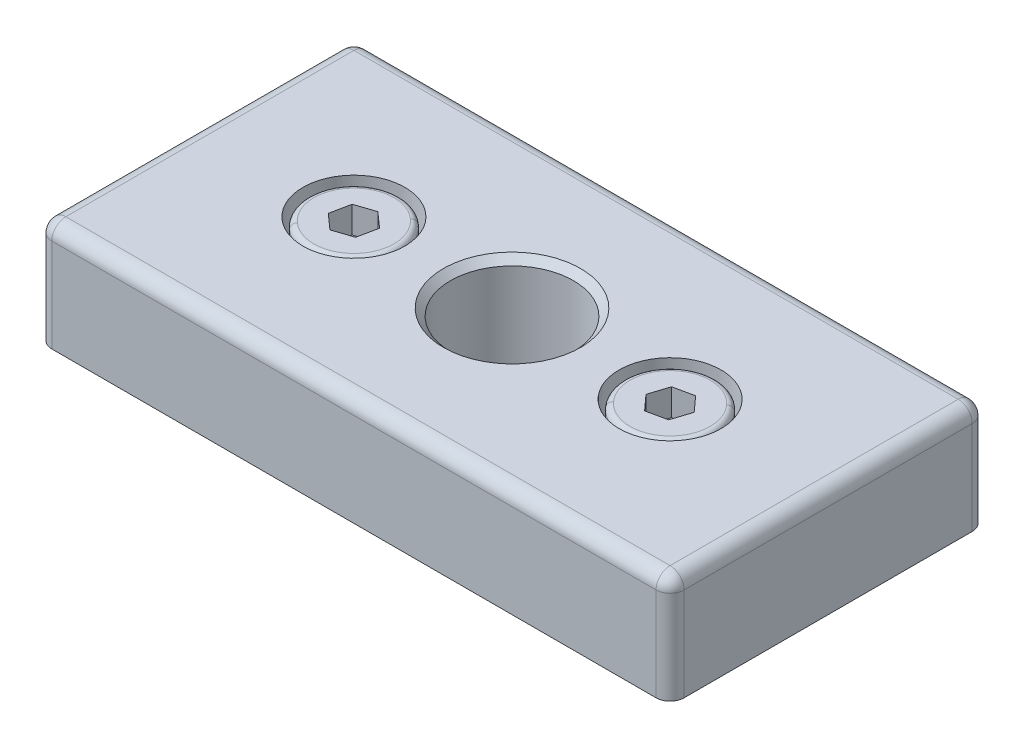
ISO-10303-21;
HEADER;
FILE_DESCRIPTION(('STEP AP214'),'2;1');
FILE_NAME('part.step','',(''),(''),'','','');
FILE_SCHEMA(('AUTOMOTIVE_DESIGN { 1 0 10303 214 1 1 1 1 }'));
ENDSEC;
DATA;
#1=APPLICATION_CONTEXT('core data for automotive mechanical design processes');
#2=APPLICATION_PROTOCOL_DEFINITION('international standard','automotive_design',2000,#1);
#3=PRODUCT_CONTEXT('',#1,'mechanical');
#4=PRODUCT('Part','Part','',(#3));
#5=PRODUCT_RELATED_PRODUCT_CATEGORY('part','',(#4));
#6=PRODUCT_DEFINITION_FORMATION('','',#4);
#7=PRODUCT_DEFINITION_CONTEXT('part definition',#1,'design');
#8=PRODUCT_DEFINITION('design','',#6,#7);
#9=PRODUCT_DEFINITION_SHAPE('','',#8);
#10=(LENGTH_UNIT() NAMED_UNIT(*) SI_UNIT(.MILLI.,.METRE.));
#11=(NAMED_UNIT(*) PLANE_ANGLE_UNIT() SI_UNIT($,.RADIAN.));
#12=(NAMED_UNIT(*) SI_UNIT($,.STERADIAN.) SOLID_ANGLE_UNIT());
#13=UNCERTAINTY_MEASURE_WITH_UNIT(LENGTH_MEASURE(1.E-05),#10,'distance_accuracy_value','');
#14=(GEOMETRIC_REPRESENTATION_CONTEXT(3) GLOBAL_UNCERTAINTY_ASSIGNED_CONTEXT((#13)) GLOBAL_UNIT_ASSIGNED_CONTEXT((#10,
#11,#12)) REPRESENTATION_CONTEXT('',''));
#15=CARTESIAN_POINT('',(0.,0.,0.));
#16=DIRECTION('',(0.,0.,1.));
#17=DIRECTION('',(1.,0.,0.));
#18=AXIS2_PLACEMENT_3D('',#15,#16,#17);
#19=CARTESIAN_POINT('',(-25.7080429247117,6.7419550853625,-0.611603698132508));
#20=DIRECTION('',(0.,1.,0.));
#21=DIRECTION('',(-0.663757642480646,0.,0.747947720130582));
#22=AXIS2_PLACEMENT_3D('',#19,#20,#21);
#23=CONICAL_SURFACE('',#22,2.5,1.0471975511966);
#24=DIRECTION('',(0.574830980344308,0.5,-0.647741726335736));
#25=VECTOR('',#24,1.);
#26=CARTESIAN_POINT('',(-24.04864881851,6.7419550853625,-2.48147299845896));
#27=LINE('',#26,#25);
#28=CARTESIAN_POINT('',(-25.7080429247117,5.29857941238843,-0.611603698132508));
#29=VERTEX_POINT('',#28);
#30=CARTESIAN_POINT('',(-24.04864881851,6.7419550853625,-2.48147299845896));
#31=VERTEX_POINT('',#30);
#32=EDGE_CURVE('P0_E333',#29,#31,#27,.T.);
#33=ORIENTED_EDGE('',*,*,#32,.F.);
#34=DIRECTION('',(-0.574830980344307,0.5,0.647741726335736));
#35=VECTOR('',#34,1.);
#36=CARTESIAN_POINT('',(-27.3674370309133,6.7419550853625,1.25826560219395));
#37=LINE('',#36,#35);
#38=CARTESIAN_POINT('',(-27.3674370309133,6.7419550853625,1.25826560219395));
#39=VERTEX_POINT('',#38);
#40=EDGE_CURVE('P0_E336',#29,#39,#37,.T.);
#41=ORIENTED_EDGE('',*,*,#40,.T.);
#42=CARTESIAN_POINT('',(-25.7080429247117,6.7419550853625,-0.611603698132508));
#43=DIRECTION('',(0.,1.,0.));
#44=DIRECTION('',(-0.663757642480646,0.,0.747947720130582));
#45=AXIS2_PLACEMENT_3D('',#42,#43,#44);
#46=CIRCLE('',#45,2.5);
#47=CARTESIAN_POINT('',(-24.9183856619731,6.7419550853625,1.76040840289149));
#48=VERTEX_POINT('',#47);
#49=EDGE_CURVE('P0_E10',#39,#48,#46,.T.);
#50=ORIENTED_EDGE('',*,*,#49,.T.);
#51=CARTESIAN_POINT('',(-25.7080429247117,6.7419550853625,-0.611603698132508));
#52=DIRECTION('',(0.,1.,0.));
#53=DIRECTION('',(-0.663757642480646,0.,0.747947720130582));
#54=AXIS2_PLACEMENT_3D('',#51,#52,#53);
#55=CIRCLE('',#54,2.5);
#56=CARTESIAN_POINT('',(-23.2589915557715,6.7419550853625,-0.109460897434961));
#57=VERTEX_POINT('',#56);
#58=EDGE_CURVE('P0_E26',#48,#57,#55,.T.);
#59=ORIENTED_EDGE('',*,*,#58,.T.);
#60=CARTESIAN_POINT('',(-25.7080429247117,6.7419550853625,-0.611603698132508));
#61=DIRECTION('',(0.,1.,0.));
#62=DIRECTION('',(-0.663757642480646,0.,0.747947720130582));
#63=AXIS2_PLACEMENT_3D('',#60,#61,#62);
#64=CIRCLE('',#63,2.5);
#65=EDGE_CURVE('P0_E19',#57,#31,#64,.T.);
#66=ORIENTED_EDGE('',*,*,#65,.T.);
#67=EDGE_LOOP('',(#33,#41,#50,#59,#66));
#68=FACE_BOUND('',#67,.T.);
#69=ADVANCED_FACE('P0_F16',(#68),#23,.F.);
#70=CARTESIAN_POINT('',(-26.2878674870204,6.7419550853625,2.21631723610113));
#71=DIRECTION('',(0.,1.,0.));
#72=DIRECTION('',(-0.663757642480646,0.,0.747947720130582));
#73=AXIS2_PLACEMENT_3D('',#70,#71,#72);
#74=PLANE('',#73);
#75=ORIENTED_EDGE('',*,*,#49,.F.);
#76=DIRECTION('',(0.747947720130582,0.,0.663757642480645));
#77=VECTOR('',#76,1.);
#78=CARTESIAN_POINT('',(-28.4470065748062,6.7419550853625,0.300213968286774));
#79=LINE('',#78,#77);
#80=CARTESIAN_POINT('',(-26.2878674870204,6.7419550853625,2.21631723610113));
#81=VERTEX_POINT('',#80);
#82=EDGE_CURVE('P0_E294',#39,#81,#79,.T.);
#83=ORIENTED_EDGE('',*,*,#82,.T.);
#84=DIRECTION('',(-0.9488048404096,0.,0.315862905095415));
#85=VECTOR('',#84,1.);
#86=CARTESIAN_POINT('',(-23.5489038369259,6.7419550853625,1.30449956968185));
#87=LINE('',#86,#85);
#88=EDGE_CURVE('P0_E275',#48,#81,#87,.T.);
#89=ORIENTED_EDGE('',*,*,#88,.F.);
#90=EDGE_LOOP('',(#75,#83,#89));
#91=FACE_BOUND('',#90,.T.);
#92=ADVANCED_FACE('P0_F598',(#91),#74,.T.);
#93=CARTESIAN_POINT('',(-26.2878674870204,6.7419550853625,2.21631723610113));
#94=DIRECTION('',(0.,1.,0.));
#95=DIRECTION('',(-0.663757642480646,0.,0.747947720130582));
#96=AXIS2_PLACEMENT_3D('',#93,#94,#95);
#97=PLANE('',#96);
#98=ORIENTED_EDGE('',*,*,#58,.F.);
#99=DIRECTION('',(-0.9488048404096,0.,0.315862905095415));
#100=VECTOR('',#99,1.);
#101=CARTESIAN_POINT('',(-23.5489038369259,6.7419550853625,1.30449956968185));
#102=LINE('',#101,#100);
#103=CARTESIAN_POINT('',(-23.5489038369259,6.7419550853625,1.30449956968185));
#104=VERTEX_POINT('',#103);
#105=EDGE_CURVE('P0_E271',#104,#48,#102,.T.);
#106=ORIENTED_EDGE('',*,*,#105,.F.);
#107=DIRECTION('',(0.200857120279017,0.,-0.97962054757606));
#108=VECTOR('',#107,1.);
#109=CARTESIAN_POINT('',(-23.5489038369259,6.7419550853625,1.30449956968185));
#110=LINE('',#109,#108);
#111=EDGE_CURVE('P0_E207',#104,#57,#110,.T.);
#112=ORIENTED_EDGE('',*,*,#111,.T.);
#113=EDGE_LOOP('',(#98,#106,#112));
#114=FACE_BOUND('',#113,.T.);
#115=ADVANCED_FACE('P0_F599',(#114),#97,.T.);
#116=CARTESIAN_POINT('',(-26.2878674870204,6.7419550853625,2.21631723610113));
#117=DIRECTION('',(0.,1.,0.));
#118=DIRECTION('',(-0.663757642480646,0.,0.747947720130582));
#119=AXIS2_PLACEMENT_3D('',#116,#117,#118);
#120=PLANE('',#119);
#121=ORIENTED_EDGE('',*,*,#65,.F.);
#122=DIRECTION('',(0.200857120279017,0.,-0.97962054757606));
#123=VECTOR('',#122,1.);
#124=CARTESIAN_POINT('',(-23.5489038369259,6.7419550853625,1.30449956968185));
#125=LINE('',#124,#123);
#126=CARTESIAN_POINT('',(-22.9690792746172,6.7419550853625,-1.52342136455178));
#127=VERTEX_POINT('',#126);
#128=EDGE_CURVE('P0_E205',#57,#127,#125,.T.);
#129=ORIENTED_EDGE('',*,*,#128,.T.);
#130=DIRECTION('',(-0.747947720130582,0.,-0.663757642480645));
#131=VECTOR('',#130,1.);
#132=CARTESIAN_POINT('',(-22.9690792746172,6.7419550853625,-1.52342136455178));
#133=LINE('',#132,#131);
#134=EDGE_CURVE('P0_E175',#127,#31,#133,.T.);
#135=ORIENTED_EDGE('',*,*,#134,.T.);
#136=EDGE_LOOP('',(#121,#129,#135));
#137=FACE_BOUND('',#136,.T.);
#138=ADVANCED_FACE('P0_F609',(#137),#120,.T.);
#139=CARTESIAN_POINT('',(-26.2878674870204,6.7419550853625,2.21631723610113));
#140=DIRECTION('',(0.,1.,0.));
#141=DIRECTION('',(-0.663757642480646,0.,0.747947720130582));
#142=AXIS2_PLACEMENT_3D('',#139,#140,#141);
#143=PLANE('',#142);
#144=CARTESIAN_POINT('',(-25.7080429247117,6.7419550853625,-0.611603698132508));
#145=DIRECTION('',(0.,1.,0.));
#146=DIRECTION('',(-0.663757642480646,0.,0.747947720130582));
#147=AXIS2_PLACEMENT_3D('',#144,#145,#146);
#148=CIRCLE('',#147,2.5);
#149=CARTESIAN_POINT('',(-26.4977001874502,6.7419550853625,-2.9836157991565));
#150=VERTEX_POINT('',#149);
#151=EDGE_CURVE('P0_E170',#31,#150,#148,.T.);
#152=ORIENTED_EDGE('',*,*,#151,.F.);
#153=DIRECTION('',(-0.747947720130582,0.,-0.663757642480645));
#154=VECTOR('',#153,1.);
#155=CARTESIAN_POINT('',(-22.9690792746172,6.7419550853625,-1.52342136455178));
#156=LINE('',#155,#154);
#157=CARTESIAN_POINT('',(-25.1282183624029,6.7419550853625,-3.43952463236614));
#158=VERTEX_POINT('',#157);
#159=EDGE_CURVE('P0_E163',#31,#158,#156,.T.);
#160=ORIENTED_EDGE('',*,*,#159,.T.);
#161=DIRECTION('',(0.9488048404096,0.,-0.315862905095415));
#162=VECTOR('',#161,1.);
#163=CARTESIAN_POINT('',(-27.8671820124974,6.7419550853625,-2.52770696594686));
#164=LINE('',#163,#162);
#165=EDGE_CURVE('P0_E167',#150,#158,#164,.T.);
#166=ORIENTED_EDGE('',*,*,#165,.F.);
#167=EDGE_LOOP('',(#152,#160,#166));
#168=FACE_BOUND('',#167,.T.);
#169=ADVANCED_FACE('P0_F165',(#168),#143,.T.);
#170=CARTESIAN_POINT('',(-26.2878674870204,6.7419550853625,2.21631723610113));
#171=DIRECTION('',(0.,1.,0.));
#172=DIRECTION('',(-0.663757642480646,0.,0.747947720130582));
#173=AXIS2_PLACEMENT_3D('',#170,#171,#172);
#174=PLANE('',#173);
#175=CARTESIAN_POINT('',(-25.7080429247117,6.7419550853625,-0.611603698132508));
#176=DIRECTION('',(0.,1.,0.));
#177=DIRECTION('',(-0.663757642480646,0.,0.747947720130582));
#178=AXIS2_PLACEMENT_3D('',#175,#176,#177);
#179=CIRCLE('',#178,2.5);
#180=CARTESIAN_POINT('',(-28.1570942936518,6.7419550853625,-1.11374649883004));
#181=VERTEX_POINT('',#180);
#182=EDGE_CURVE('P0_E317',#150,#181,#179,.T.);
#183=ORIENTED_EDGE('',*,*,#182,.F.);
#184=DIRECTION('',(0.9488048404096,0.,-0.315862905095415));
#185=VECTOR('',#184,1.);
#186=CARTESIAN_POINT('',(-27.8671820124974,6.7419550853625,-2.52770696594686));
#187=LINE('',#186,#185);
#188=CARTESIAN_POINT('',(-27.8671820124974,6.7419550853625,-2.52770696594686));
#189=VERTEX_POINT('',#188);
#190=EDGE_CURVE('P0_E189',#189,#150,#187,.T.);
#191=ORIENTED_EDGE('',*,*,#190,.F.);
#192=DIRECTION('',(0.200857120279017,0.,-0.97962054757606));
#193=VECTOR('',#192,1.);
#194=CARTESIAN_POINT('',(-28.4470065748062,6.7419550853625,0.300213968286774));
#195=LINE('',#194,#193);
#196=EDGE_CURVE('P0_E291',#181,#189,#195,.T.);
#197=ORIENTED_EDGE('',*,*,#196,.F.);
#198=EDGE_LOOP('',(#183,#191,#197));
#199=FACE_BOUND('',#198,.T.);
#200=ADVANCED_FACE('P0_F315',(#199),#174,.T.);
#201=CARTESIAN_POINT('',(-26.2878674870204,6.7419550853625,2.21631723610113));
#202=DIRECTION('',(0.,1.,0.));
#203=DIRECTION('',(-0.663757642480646,0.,0.747947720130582));
#204=AXIS2_PLACEMENT_3D('',#201,#202,#203);
#205=PLANE('',#204);
#206=CARTESIAN_POINT('',(-25.7080429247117,6.7419550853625,-0.611603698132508));
#207=DIRECTION('',(0.,1.,0.));
#208=DIRECTION('',(-0.663757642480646,0.,0.747947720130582));
#209=AXIS2_PLACEMENT_3D('',#206,#207,#208);
#210=CIRCLE('',#209,2.5);
#211=EDGE_CURVE('P0_E344',#181,#39,#210,.T.);
#212=ORIENTED_EDGE('',*,*,#211,.F.);
#213=DIRECTION('',(0.200857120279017,0.,-0.97962054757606));
#214=VECTOR('',#213,1.);
#215=CARTESIAN_POINT('',(-28.4470065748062,6.7419550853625,0.300213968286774));
#216=LINE('',#215,#214);
#217=CARTESIAN_POINT('',(-28.4470065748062,6.7419550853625,0.300213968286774));
#218=VERTEX_POINT('',#217);
#219=EDGE_CURVE('P0_E302',#218,#181,#216,.T.);
#220=ORIENTED_EDGE('',*,*,#219,.F.);
#221=DIRECTION('',(0.747947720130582,0.,0.663757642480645));
#222=VECTOR('',#221,1.);
#223=CARTESIAN_POINT('',(-28.4470065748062,6.7419550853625,0.300213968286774));
#224=LINE('',#223,#222);
#225=EDGE_CURVE('P0_E297',#218,#39,#224,.T.);
#226=ORIENTED_EDGE('',*,*,#225,.T.);
#227=EDGE_LOOP('',(#212,#220,#226));
#228=FACE_BOUND('',#227,.T.);
#229=ADVANCED_FACE('P0_F590',(#228),#205,.T.);
#230=CARTESIAN_POINT('',(-23.5489038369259,6.7419550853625,1.30449956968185));
#231=DIRECTION('',(0.97962054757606,0.,0.200857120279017));
#232=DIRECTION('',(0.,1.,0.));
#233=AXIS2_PLACEMENT_3D('',#230,#231,#232);
#234=PLANE('',#233);
#235=DIRECTION('',(0.200857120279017,0.,-0.97962054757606));
#236=VECTOR('',#235,1.);
#237=CARTESIAN_POINT('',(-23.5489038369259,10.5419550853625,1.30449956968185));
#238=LINE('',#237,#236);
#239=CARTESIAN_POINT('',(-23.5489038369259,10.5419550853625,1.30449956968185));
#240=VERTEX_POINT('',#239);
#241=CARTESIAN_POINT('',(-22.9690792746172,10.5419550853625,-1.52342136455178));
#242=VERTEX_POINT('',#241);
#243=EDGE_CURVE('P0_E260',#240,#242,#238,.T.);
#244=ORIENTED_EDGE('',*,*,#243,.T.);
#245=DIRECTION('',(0.,1.,0.));
#246=VECTOR('',#245,1.);
#247=CARTESIAN_POINT('',(-22.9690792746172,6.7419550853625,-1.52342136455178));
#248=LINE('',#247,#246);
#249=EDGE_CURVE('P0_E203',#127,#242,#248,.T.);
#250=ORIENTED_EDGE('',*,*,#249,.F.);
#251=ORIENTED_EDGE('',*,*,#128,.F.);
#252=ORIENTED_EDGE('',*,*,#111,.F.);
#253=DIRECTION('',(0.,1.,0.));
#254=VECTOR('',#253,1.);
#255=CARTESIAN_POINT('',(-23.5489038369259,6.7419550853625,1.30449956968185));
#256=LINE('',#255,#254);
#257=EDGE_CURVE('P0_E276',#104,#240,#256,.T.);
#258=ORIENTED_EDGE('',*,*,#257,.T.);
#259=EDGE_LOOP('',(#244,#250,#251,#252,#258));
#260=FACE_BOUND('',#259,.T.);
#261=ADVANCED_FACE('P0_F606',(#260),#234,.F.);
#262=CARTESIAN_POINT('',(-22.9690792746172,6.7419550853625,-1.52342136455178));
#263=DIRECTION('',(0.663757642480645,0.,-0.747947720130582));
#264=DIRECTION('',(-0.747947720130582,0.,-0.663757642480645));
#265=AXIS2_PLACEMENT_3D('',#262,#263,#264);
#266=PLANE('',#265);
#267=DIRECTION('',(-0.747947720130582,0.,-0.663757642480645));
#268=VECTOR('',#267,1.);
#269=CARTESIAN_POINT('',(-22.9690792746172,10.5419550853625,-1.52342136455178));
#270=LINE('',#269,#268);
#271=CARTESIAN_POINT('',(-25.1282183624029,10.5419550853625,-3.43952463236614));
#272=VERTEX_POINT('',#271);
#273=EDGE_CURVE('P0_E181',#242,#272,#270,.T.);
#274=ORIENTED_EDGE('',*,*,#273,.T.);
#275=DIRECTION('',(0.,1.,0.));
#276=VECTOR('',#275,1.);
#277=CARTESIAN_POINT('',(-25.1282183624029,6.7419550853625,-3.43952463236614));
#278=LINE('',#277,#276);
#279=EDGE_CURVE('P0_E176',#158,#272,#278,.T.);
#280=ORIENTED_EDGE('',*,*,#279,.F.);
#281=ORIENTED_EDGE('',*,*,#159,.F.);
#282=ORIENTED_EDGE('',*,*,#134,.F.);
#283=ORIENTED_EDGE('',*,*,#249,.T.);
#284=EDGE_LOOP('',(#274,#280,#281,#282,#283));
#285=FACE_BOUND('',#284,.T.);
#286=ADVANCED_FACE('P0_F179',(#285),#266,.F.);
#287=CARTESIAN_POINT('',(-27.8671820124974,6.7419550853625,-2.52770696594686));
#288=DIRECTION('',(0.315862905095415,0.,0.9488048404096));
#289=DIRECTION('',(0.,-1.,0.));
#290=AXIS2_PLACEMENT_3D('',#287,#288,#289);
#291=PLANE('',#290);
#292=DIRECTION('',(0.9488048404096,0.,-0.315862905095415));
#293=VECTOR('',#292,1.);
#294=CARTESIAN_POINT('',(-27.8671820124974,10.5419550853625,-2.52770696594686));
#295=LINE('',#294,#293);
#296=CARTESIAN_POINT('',(-27.8671820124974,10.5419550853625,-2.52770696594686));
#297=VERTEX_POINT('',#296);
#298=EDGE_CURVE('P0_E254',#297,#272,#295,.T.);
#299=ORIENTED_EDGE('',*,*,#298,.F.);
#300=DIRECTION('',(0.,1.,0.));
#301=VECTOR('',#300,1.);
#302=CARTESIAN_POINT('',(-27.8671820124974,6.7419550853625,-2.52770696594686));
#303=LINE('',#302,#301);
#304=EDGE_CURVE('P0_E197',#189,#297,#303,.T.);
#305=ORIENTED_EDGE('',*,*,#304,.F.);
#306=ORIENTED_EDGE('',*,*,#190,.T.);
#307=ORIENTED_EDGE('',*,*,#165,.T.);
#308=ORIENTED_EDGE('',*,*,#279,.T.);
#309=EDGE_LOOP('',(#299,#305,#306,#307,#308));
#310=FACE_BOUND('',#309,.T.);
#311=ADVANCED_FACE('P0_F187',(#310),#291,.T.);
#312=CARTESIAN_POINT('',(-28.4470065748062,6.7419550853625,0.300213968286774));
#313=DIRECTION('',(0.97962054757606,0.,0.200857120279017));
#314=DIRECTION('',(0.,1.,0.));
#315=AXIS2_PLACEMENT_3D('',#312,#313,#314);
#316=PLANE('',#315);
#317=DIRECTION('',(0.200857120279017,0.,-0.97962054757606));
#318=VECTOR('',#317,1.);
#319=CARTESIAN_POINT('',(-28.4470065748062,10.5419550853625,0.300213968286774));
#320=LINE('',#319,#318);
#321=CARTESIAN_POINT('',(-28.4470065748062,10.5419550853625,0.300213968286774));
#322=VERTEX_POINT('',#321);
#323=EDGE_CURVE('P0_E257',#322,#297,#320,.T.);
#324=ORIENTED_EDGE('',*,*,#323,.F.);
#325=DIRECTION('',(0.,1.,0.));
#326=VECTOR('',#325,1.);
#327=CARTESIAN_POINT('',(-28.4470065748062,6.7419550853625,0.300213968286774));
#328=LINE('',#327,#326);
#329=EDGE_CURVE('P0_E301',#218,#322,#328,.T.);
#330=ORIENTED_EDGE('',*,*,#329,.F.);
#331=ORIENTED_EDGE('',*,*,#219,.T.);
#332=ORIENTED_EDGE('',*,*,#196,.T.);
#333=ORIENTED_EDGE('',*,*,#304,.T.);
#334=EDGE_LOOP('',(#324,#330,#331,#332,#333));
#335=FACE_BOUND('',#334,.T.);
#336=ADVANCED_FACE('P0_F311',(#335),#316,.T.);
#337=CARTESIAN_POINT('',(-28.4470065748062,6.7419550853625,0.300213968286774));
#338=DIRECTION('',(-0.663757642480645,0.,0.747947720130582));
#339=DIRECTION('',(-0.747947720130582,0.,-0.663757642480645));
#340=AXIS2_PLACEMENT_3D('',#337,#338,#339);
#341=PLANE('',#340);
#342=DIRECTION('',(0.747947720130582,0.,0.663757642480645));
#343=VECTOR('',#342,1.);
#344=CARTESIAN_POINT('',(-28.4470065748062,10.5419550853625,0.300213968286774));
#345=LINE('',#344,#343);
#346=CARTESIAN_POINT('',(-26.2878674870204,10.5419550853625,2.21631723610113));
#347=VERTEX_POINT('',#346);
#348=EDGE_CURVE('P0_E251',#322,#347,#345,.T.);
#349=ORIENTED_EDGE('',*,*,#348,.T.);
#350=DIRECTION('',(0.,1.,0.));
#351=VECTOR('',#350,1.);
#352=CARTESIAN_POINT('',(-26.2878674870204,6.7419550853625,2.21631723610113));
#353=LINE('',#352,#351);
#354=EDGE_CURVE('P0_E288',#81,#347,#353,.T.);
#355=ORIENTED_EDGE('',*,*,#354,.F.);
#356=ORIENTED_EDGE('',*,*,#82,.F.);
#357=ORIENTED_EDGE('',*,*,#225,.F.);
#358=ORIENTED_EDGE('',*,*,#329,.T.);
#359=EDGE_LOOP('',(#349,#355,#356,#357,#358));
#360=FACE_BOUND('',#359,.T.);
#361=ADVANCED_FACE('P0_F595',(#360),#341,.F.);
#362=CARTESIAN_POINT('',(-23.5489038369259,6.7419550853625,1.30449956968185));
#363=DIRECTION('',(-0.315862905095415,0.,-0.9488048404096));
#364=DIRECTION('',(0.9488048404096,0.,-0.315862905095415));
#365=AXIS2_PLACEMENT_3D('',#362,#363,#364);
#366=PLANE('',#365);
#367=DIRECTION('',(-0.9488048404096,0.,0.315862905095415));
#368=VECTOR('',#367,1.);
#369=CARTESIAN_POINT('',(-23.5489038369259,10.5419550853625,1.30449956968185));
#370=LINE('',#369,#368);
#371=EDGE_CURVE('P0_E247',#240,#347,#370,.T.);
#372=ORIENTED_EDGE('',*,*,#371,.F.);
#373=ORIENTED_EDGE('',*,*,#257,.F.);
#374=ORIENTED_EDGE('',*,*,#105,.T.);
#375=ORIENTED_EDGE('',*,*,#88,.T.);
#376=ORIENTED_EDGE('',*,*,#354,.T.);
#377=EDGE_LOOP('',(#372,#373,#374,#375,#376));
#378=FACE_BOUND('',#377,.T.);
#379=ADVANCED_FACE('P0_F603',(#378),#366,.T.);
#380=CARTESIAN_POINT('',(-25.7080429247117,9.7419550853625,-0.611603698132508));
#381=DIRECTION('',(0.,1.,0.));
#382=DIRECTION('',(-0.663757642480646,0.,0.747947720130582));
#383=AXIS2_PLACEMENT_3D('',#380,#381,#382);
#384=TOROIDAL_SURFACE('',#383,5.7,0.8);
#385=CARTESIAN_POINT('',(-21.924624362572,9.7419550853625,-4.87490570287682));
#386=DIRECTION('',(0.747947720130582,0.,0.663757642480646));
#387=DIRECTION('',(-0.663757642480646,0.,0.747947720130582));
#388=AXIS2_PLACEMENT_3D('',#385,#386,#387);
#389=CIRCLE('',#388,0.8);
#390=CARTESIAN_POINT('',(-21.3936182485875,9.7419550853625,-5.47326387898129));
#391=VERTEX_POINT('',#390);
#392=CARTESIAN_POINT('',(-21.924624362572,10.5419550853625,-4.87490570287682));
#393=VERTEX_POINT('',#392);
#394=EDGE_CURVE('P0_E343',#391,#393,#389,.T.);
#395=ORIENTED_EDGE('',*,*,#394,.F.);
#396=CARTESIAN_POINT('',(-25.7080429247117,9.7419550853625,-0.611603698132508));
#397=DIRECTION('',(0.,-1.,0.));
#398=DIRECTION('',(-0.663757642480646,0.,0.747947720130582));
#399=AXIS2_PLACEMENT_3D('',#396,#397,#398);
#400=CIRCLE('',#399,6.5);
#401=CARTESIAN_POINT('',(-30.0224676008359,9.7419550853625,4.25005648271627));
#402=VERTEX_POINT('',#401);
#403=EDGE_CURVE('P0_E267',#402,#391,#400,.T.);
#404=ORIENTED_EDGE('',*,*,#403,.F.);
#405=CARTESIAN_POINT('',(-29.4914614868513,9.7419550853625,3.65169830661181));
#406=DIRECTION('',(-0.747947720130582,0.,-0.663757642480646));
#407=DIRECTION('',(0.663757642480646,0.,-0.747947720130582));
#408=AXIS2_PLACEMENT_3D('',#405,#406,#407);
#409=CIRCLE('',#408,0.8);
#410=CARTESIAN_POINT('',(-29.4914614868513,10.5419550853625,3.65169830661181));
#411=VERTEX_POINT('',#410);
#412=EDGE_CURVE('P0_E362',#402,#411,#409,.T.);
#413=ORIENTED_EDGE('',*,*,#412,.T.);
#414=CARTESIAN_POINT('',(-25.7080429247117,10.5419550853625,-0.611603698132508));
#415=DIRECTION('',(0.,1.,0.));
#416=DIRECTION('',(-0.663757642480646,0.,0.747947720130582));
#417=AXIS2_PLACEMENT_3D('',#414,#415,#416);
#418=CIRCLE('',#417,5.7);
#419=EDGE_CURVE('P0_E244',#393,#411,#418,.T.);
#420=ORIENTED_EDGE('',*,*,#419,.F.);
#421=EDGE_LOOP('',(#395,#404,#413,#420));
#422=FACE_BOUND('',#421,.T.);
#423=ADVANCED_FACE('P0_F640',(#422),#384,.T.);
#424=CARTESIAN_POINT('',(-25.7080429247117,5.1419550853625,-0.611603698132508));
#425=DIRECTION('',(0.,-1.,0.));
#426=DIRECTION('',(0.663757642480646,0.,-0.747947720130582));
#427=AXIS2_PLACEMENT_3D('',#424,#425,#426);
#428=TOROIDAL_SURFACE('',#427,4.39999999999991,0.4);
#429=CARTESIAN_POINT('',(-28.6285765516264,5.1419550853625,2.67936627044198));
#430=DIRECTION('',(0.747947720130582,0.,0.663757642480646));
#431=DIRECTION('',(-0.663757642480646,0.,0.747947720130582));
#432=AXIS2_PLACEMENT_3D('',#429,#430,#431);
#433=CIRCLE('',#432,0.4);
#434=CARTESIAN_POINT('',(-28.3630734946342,5.1419550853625,2.38018718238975));
#435=VERTEX_POINT('',#434);
#436=CARTESIAN_POINT('',(-28.6285765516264,5.5419550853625,2.67936627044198));
#437=VERTEX_POINT('',#436);
#438=EDGE_CURVE('P0_E372',#435,#437,#433,.T.);
#439=ORIENTED_EDGE('',*,*,#438,.F.);
#440=CARTESIAN_POINT('',(-25.7080429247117,5.1419550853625,-0.611603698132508));
#441=DIRECTION('',(0.,-1.,0.));
#442=DIRECTION('',(0.663757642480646,0.,-0.747947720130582));
#443=AXIS2_PLACEMENT_3D('',#440,#441,#442);
#444=CIRCLE('',#443,3.99999999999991);
#445=CARTESIAN_POINT('',(-23.0530123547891,5.1419550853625,-3.60339457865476));
#446=VERTEX_POINT('',#445);
#447=EDGE_CURVE('P0_E227',#446,#435,#444,.T.);
#448=ORIENTED_EDGE('',*,*,#447,.F.);
#449=CARTESIAN_POINT('',(-22.7875092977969,5.1419550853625,-3.902573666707));
#450=DIRECTION('',(-0.747947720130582,0.,-0.663757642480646));
#451=DIRECTION('',(0.663757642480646,0.,-0.747947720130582));
#452=AXIS2_PLACEMENT_3D('',#449,#450,#451);
#453=CIRCLE('',#452,0.4);
#454=CARTESIAN_POINT('',(-22.7875092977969,5.5419550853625,-3.902573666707));
#455=VERTEX_POINT('',#454);
#456=EDGE_CURVE('P0_E354',#446,#455,#453,.T.);
#457=ORIENTED_EDGE('',*,*,#456,.T.);
#458=CARTESIAN_POINT('',(-25.7080429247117,5.5419550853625,-0.611603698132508));
#459=DIRECTION('',(0.,1.,0.));
#460=DIRECTION('',(0.663757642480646,0.,-0.747947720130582));
#461=AXIS2_PLACEMENT_3D('',#458,#459,#460);
#462=CIRCLE('',#461,4.39999999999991);
#463=EDGE_CURVE('P0_E270',#437,#455,#462,.T.);
#464=ORIENTED_EDGE('',*,*,#463,.F.);
#465=EDGE_LOOP('',(#439,#448,#457,#464));
#466=FACE_BOUND('',#465,.T.);
#467=ADVANCED_FACE('P0_F643',(#466),#428,.F.);
#468=CARTESIAN_POINT('',(-23.2327099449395,-19.4580449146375,1.58510221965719));
#469=DIRECTION('',(0.,-1.,0.));
#470=DIRECTION('',(0.747947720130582,0.,0.663757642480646));
#471=AXIS2_PLACEMENT_3D('',#468,#469,#470);
#472=PLANE('',#471);
#473=CARTESIAN_POINT('',(-25.7080429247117,-19.4580449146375,-0.611603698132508));
#474=DIRECTION('',(0.,1.,0.));
#475=DIRECTION('',(-0.663757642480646,0.,0.747947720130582));
#476=AXIS2_PLACEMENT_3D('',#473,#474,#475);
#477=CIRCLE('',#476,3.3095);
#478=CARTESIAN_POINT('',(-27.9047488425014,-19.4580449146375,1.86372928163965));
#479=VERTEX_POINT('',#478);
#480=CARTESIAN_POINT('',(-23.511337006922,-19.4580449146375,-3.08693667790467));
#481=VERTEX_POINT('',#480);
#482=EDGE_CURVE('P0_E350',#479,#481,#477,.T.);
#483=ORIENTED_EDGE('',*,*,#482,.F.);
#484=CARTESIAN_POINT('',(-25.7080429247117,-19.4580449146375,-0.611603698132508));
#485=DIRECTION('',(0.,1.,0.));
#486=DIRECTION('',(-0.663757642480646,0.,0.747947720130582));
#487=AXIS2_PLACEMENT_3D('',#484,#485,#486);
#488=CIRCLE('',#487,3.3095);
#489=EDGE_CURVE('P0_E280',#481,#479,#488,.T.);
#490=ORIENTED_EDGE('',*,*,#489,.F.);
#491=EDGE_LOOP('',(#483,#490));
#492=FACE_BOUND('',#491,.T.);
#493=ADVANCED_FACE('P0_F649',(#492),#472,.T.);
#494=CARTESIAN_POINT('',(-25.7080429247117,-19.4580449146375,-0.611603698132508));
#495=DIRECTION('',(0.,1.,0.));
#496=DIRECTION('',(-0.663757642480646,0.,0.747947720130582));
#497=AXIS2_PLACEMENT_3D('',#494,#495,#496);
#498=CONICAL_SURFACE('',#497,3.3095,0.785398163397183);
#499=DIRECTION('',(0.469347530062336,0.707106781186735,-0.528878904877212));
#500=VECTOR('',#499,1.);
#501=CARTESIAN_POINT('',(-23.511337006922,-19.4580449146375,-3.08693667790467));
#502=LINE('',#501,#500);
#503=CARTESIAN_POINT('',(-23.0530123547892,-18.7675449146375,-3.60339457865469));
#504=VERTEX_POINT('',#503);
#505=EDGE_CURVE('P0_E345',#481,#504,#502,.T.);
#506=ORIENTED_EDGE('',*,*,#505,.F.);
#507=ORIENTED_EDGE('',*,*,#489,.T.);
#508=DIRECTION('',(-0.469347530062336,0.707106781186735,0.528878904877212));
#509=VECTOR('',#508,1.);
#510=CARTESIAN_POINT('',(-27.9047488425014,-19.4580449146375,1.86372928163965));
#511=LINE('',#510,#509);
#512=CARTESIAN_POINT('',(-28.3630734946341,-18.7675449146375,2.38018718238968));
#513=VERTEX_POINT('',#512);
#514=EDGE_CURVE('P0_E384',#479,#513,#511,.T.);
#515=ORIENTED_EDGE('',*,*,#514,.T.);
#516=CARTESIAN_POINT('',(-25.7080429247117,-18.7675449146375,-0.611603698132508));
#517=DIRECTION('',(0.,1.,0.));
#518=DIRECTION('',(-0.663757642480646,0.,0.747947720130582));
#519=AXIS2_PLACEMENT_3D('',#516,#517,#518);
#520=CIRCLE('',#519,3.99999999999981);
#521=EDGE_CURVE('P0_E277',#504,#513,#520,.T.);
#522=ORIENTED_EDGE('',*,*,#521,.F.);
#523=EDGE_LOOP('',(#506,#507,#515,#522));
#524=FACE_BOUND('',#523,.T.);
#525=ADVANCED_FACE('P0_F653',(#524),#498,.T.);
#526=CARTESIAN_POINT('',(-25.7080429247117,42.2919550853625,-0.611603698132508));
#527=DIRECTION('',(0.,1.,0.));
#528=DIRECTION('',(-0.663757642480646,0.,0.747947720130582));
#529=AXIS2_PLACEMENT_3D('',#526,#527,#528);
#530=CYLINDRICAL_SURFACE('',#529,3.99999999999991);
#531=DIRECTION('',(0.,1.,0.));
#532=VECTOR('',#531,1.);
#533=CARTESIAN_POINT('',(-23.0530123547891,42.2919550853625,-3.60339457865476));
#534=LINE('',#533,#532);
#535=EDGE_CURVE('P0_E225',#504,#446,#534,.T.);
#536=ORIENTED_EDGE('',*,*,#535,.F.);
#537=ORIENTED_EDGE('',*,*,#521,.T.);
#538=DIRECTION('',(0.,1.,0.));
#539=VECTOR('',#538,1.);
#540=CARTESIAN_POINT('',(-28.3630734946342,42.2919550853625,2.38018718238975));
#541=LINE('',#540,#539);
#542=EDGE_CURVE('P0_E231',#513,#435,#541,.T.);
#543=ORIENTED_EDGE('',*,*,#542,.T.);
#544=CARTESIAN_POINT('',(-25.7080429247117,5.1419550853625,-0.611603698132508));
#545=DIRECTION('',(0.,-1.,0.));
#546=DIRECTION('',(0.663757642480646,0.,-0.747947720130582));
#547=AXIS2_PLACEMENT_3D('',#544,#545,#546);
#548=CIRCLE('',#547,3.99999999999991);
#549=EDGE_CURVE('P0_E366',#435,#446,#548,.T.);
#550=ORIENTED_EDGE('',*,*,#549,.T.);
#551=EDGE_LOOP('',(#536,#537,#543,#550));
#552=FACE_BOUND('',#551,.T.);
#553=ADVANCED_FACE('P0_F414',(#552),#530,.T.);
#554=CARTESIAN_POINT('',(-20.8463827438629,5.5419550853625,3.70282097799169));
#555=DIRECTION('',(0.,-1.,0.));
#556=DIRECTION('',(0.747947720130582,0.,0.663757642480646));
#557=AXIS2_PLACEMENT_3D('',#554,#555,#556);
#558=PLANE('',#557);
#559=CARTESIAN_POINT('',(-25.7080429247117,5.5419550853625,-0.611603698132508));
#560=DIRECTION('',(0.,1.,0.));
#561=DIRECTION('',(0.663757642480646,0.,-0.747947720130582));
#562=AXIS2_PLACEMENT_3D('',#559,#560,#561);
#563=CIRCLE('',#562,4.39999999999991);
#564=EDGE_CURVE('P0_E376',#455,#437,#563,.T.);
#565=ORIENTED_EDGE('',*,*,#564,.T.);
#566=ORIENTED_EDGE('',*,*,#463,.T.);
#567=EDGE_LOOP('',(#565,#566));
#568=FACE_BOUND('',#567,.T.);
#569=CARTESIAN_POINT('',(-25.7080429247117,5.5419550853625,-0.611603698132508));
#570=DIRECTION('',(0.,1.,0.));
#571=DIRECTION('',(-0.663757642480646,0.,0.747947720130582));
#572=AXIS2_PLACEMENT_3D('',#569,#570,#571);
#573=CIRCLE('',#572,6.5);
#574=CARTESIAN_POINT('',(-30.0224676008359,5.5419550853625,4.25005648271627));
#575=VERTEX_POINT('',#574);
#576=CARTESIAN_POINT('',(-21.3936182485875,5.5419550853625,-5.47326387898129));
#577=VERTEX_POINT('',#576);
#578=EDGE_CURVE('P0_E235',#575,#577,#573,.T.);
#579=ORIENTED_EDGE('',*,*,#578,.F.);
#580=CARTESIAN_POINT('',(-25.7080429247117,5.5419550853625,-0.611603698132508));
#581=DIRECTION('',(0.,1.,0.));
#582=DIRECTION('',(-0.663757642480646,0.,0.747947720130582));
#583=AXIS2_PLACEMENT_3D('',#580,#581,#582);
#584=CIRCLE('',#583,6.5);
#585=EDGE_CURVE('P0_E264',#577,#575,#584,.T.);
#586=ORIENTED_EDGE('',*,*,#585,.F.);
#587=EDGE_LOOP('',(#579,#586));
#588=FACE_BOUND('',#587,.T.);
#589=ADVANCED_FACE('P0_F659',(#568,#588),#558,.T.);
#590=CARTESIAN_POINT('',(-25.7080429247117,42.2919550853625,-0.611603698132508));
#591=DIRECTION('',(0.,1.,0.));
#592=DIRECTION('',(-0.663757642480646,0.,0.747947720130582));
#593=AXIS2_PLACEMENT_3D('',#590,#591,#592);
#594=CYLINDRICAL_SURFACE('',#593,6.5);
#595=DIRECTION('',(0.,1.,0.));
#596=VECTOR('',#595,1.);
#597=CARTESIAN_POINT('',(-21.3936182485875,42.2919550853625,-5.47326387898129));
#598=LINE('',#597,#596);
#599=EDGE_CURVE('P0_E236',#577,#391,#598,.T.);
#600=ORIENTED_EDGE('',*,*,#599,.F.);
#601=ORIENTED_EDGE('',*,*,#585,.T.);
#602=DIRECTION('',(0.,1.,0.));
#603=VECTOR('',#602,1.);
#604=CARTESIAN_POINT('',(-30.0224676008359,42.2919550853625,4.25005648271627));
#605=LINE('',#604,#603);
#606=EDGE_CURVE('P0_E240',#575,#402,#605,.T.);
#607=ORIENTED_EDGE('',*,*,#606,.T.);
#608=ORIENTED_EDGE('',*,*,#403,.T.);
#609=EDGE_LOOP('',(#600,#601,#607,#608));
#610=FACE_BOUND('',#609,.T.);
#611=ADVANCED_FACE('P0_F662',(#610),#594,.T.);
#612=CARTESIAN_POINT('',(-25.7080429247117,10.5419550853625,-0.611603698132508));
#613=DIRECTION('',(0.,1.,0.));
#614=DIRECTION('',(-0.663757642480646,0.,0.747947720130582));
#615=AXIS2_PLACEMENT_3D('',#612,#613,#614);
#616=PLANE('',#615);
#617=ORIENTED_EDGE('',*,*,#371,.T.);
#618=ORIENTED_EDGE('',*,*,#348,.F.);
#619=ORIENTED_EDGE('',*,*,#323,.T.);
#620=ORIENTED_EDGE('',*,*,#298,.T.);
#621=ORIENTED_EDGE('',*,*,#273,.F.);
#622=ORIENTED_EDGE('',*,*,#243,.F.);
#623=EDGE_LOOP('',(#617,#618,#619,#620,#621,#622));
#624=FACE_BOUND('',#623,.T.);
#625=CARTESIAN_POINT('',(-25.7080429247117,10.5419550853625,-0.611603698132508));
#626=DIRECTION('',(0.,1.,0.));
#627=DIRECTION('',(-0.663757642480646,0.,0.747947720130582));
#628=AXIS2_PLACEMENT_3D('',#625,#626,#627);
#629=CIRCLE('',#628,5.7);
#630=EDGE_CURVE('P0_E358',#411,#393,#629,.T.);
#631=ORIENTED_EDGE('',*,*,#630,.T.);
#632=ORIENTED_EDGE('',*,*,#419,.T.);
#633=EDGE_LOOP('',(#631,#632));
#634=FACE_BOUND('',#633,.T.);
#635=ADVANCED_FACE('P0_F321',(#624,#634),#616,.T.);
#636=CARTESIAN_POINT('',(-25.7080429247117,42.2919550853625,-0.611603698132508));
#637=DIRECTION('',(0.,1.,0.));
#638=DIRECTION('',(-0.663757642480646,0.,0.747947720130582));
#639=AXIS2_PLACEMENT_3D('',#636,#637,#638);
#640=CYLINDRICAL_SURFACE('',#639,6.5);
#641=ORIENTED_EDGE('',*,*,#578,.T.);
#642=ORIENTED_EDGE('',*,*,#599,.T.);
#643=CARTESIAN_POINT('',(-25.7080429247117,9.7419550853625,-0.611603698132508));
#644=DIRECTION('',(0.,-1.,0.));
#645=DIRECTION('',(-0.663757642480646,0.,0.747947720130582));
#646=AXIS2_PLACEMENT_3D('',#643,#644,#645);
#647=CIRCLE('',#646,6.5);
#648=EDGE_CURVE('P0_E339',#391,#402,#647,.T.);
#649=ORIENTED_EDGE('',*,*,#648,.T.);
#650=ORIENTED_EDGE('',*,*,#606,.F.);
#651=EDGE_LOOP('',(#641,#642,#649,#650));
#652=FACE_BOUND('',#651,.T.);
#653=ADVANCED_FACE('P0_F669',(#652),#640,.T.);
#654=CARTESIAN_POINT('',(-25.7080429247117,42.2919550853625,-0.611603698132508));
#655=DIRECTION('',(0.,1.,0.));
#656=DIRECTION('',(-0.663757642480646,0.,0.747947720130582));
#657=AXIS2_PLACEMENT_3D('',#654,#655,#656);
#658=CYLINDRICAL_SURFACE('',#657,3.99999999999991);
#659=CARTESIAN_POINT('',(-25.7080429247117,-18.7675449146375,-0.611603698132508));
#660=DIRECTION('',(0.,1.,0.));
#661=DIRECTION('',(-0.663757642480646,0.,0.747947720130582));
#662=AXIS2_PLACEMENT_3D('',#659,#660,#661);
#663=CIRCLE('',#662,3.99999999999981);
#664=EDGE_CURVE('P0_E349',#513,#504,#663,.T.);
#665=ORIENTED_EDGE('',*,*,#664,.T.);
#666=ORIENTED_EDGE('',*,*,#535,.T.);
#667=ORIENTED_EDGE('',*,*,#447,.T.);
#668=ORIENTED_EDGE('',*,*,#542,.F.);
#669=EDGE_LOOP('',(#665,#666,#667,#668));
#670=FACE_BOUND('',#669,.T.);
#671=ADVANCED_FACE('P0_F673',(#670),#658,.T.);
#672=CARTESIAN_POINT('',(-25.7080429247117,-19.4580449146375,-0.611603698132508));
#673=DIRECTION('',(0.,1.,0.));
#674=DIRECTION('',(-0.663757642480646,0.,0.747947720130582));
#675=AXIS2_PLACEMENT_3D('',#672,#673,#674);
#676=CONICAL_SURFACE('',#675,3.3095,0.785398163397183);
#677=ORIENTED_EDGE('',*,*,#482,.T.);
#678=ORIENTED_EDGE('',*,*,#505,.T.);
#679=ORIENTED_EDGE('',*,*,#664,.F.);
#680=ORIENTED_EDGE('',*,*,#514,.F.);
#681=EDGE_LOOP('',(#677,#678,#679,#680));
#682=FACE_BOUND('',#681,.T.);
#683=ADVANCED_FACE('P0_F670',(#682),#676,.T.);
#684=CARTESIAN_POINT('',(-25.7080429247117,5.1419550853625,-0.611603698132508));
#685=DIRECTION('',(0.,-1.,0.));
#686=DIRECTION('',(0.663757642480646,0.,-0.747947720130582));
#687=AXIS2_PLACEMENT_3D('',#684,#685,#686);
#688=TOROIDAL_SURFACE('',#687,4.39999999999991,0.4);
#689=ORIENTED_EDGE('',*,*,#549,.F.);
#690=ORIENTED_EDGE('',*,*,#438,.T.);
#691=ORIENTED_EDGE('',*,*,#564,.F.);
#692=ORIENTED_EDGE('',*,*,#456,.F.);
#693=EDGE_LOOP('',(#689,#690,#691,#692));
#694=FACE_BOUND('',#693,.T.);
#695=ADVANCED_FACE('P0_F417',(#694),#688,.F.);
#696=CARTESIAN_POINT('',(-25.7080429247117,9.7419550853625,-0.611603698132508));
#697=DIRECTION('',(0.,1.,0.));
#698=DIRECTION('',(-0.663757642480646,0.,0.747947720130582));
#699=AXIS2_PLACEMENT_3D('',#696,#697,#698);
#700=TOROIDAL_SURFACE('',#699,5.7,0.8);
#701=ORIENTED_EDGE('',*,*,#648,.F.);
#702=ORIENTED_EDGE('',*,*,#394,.T.);
#703=ORIENTED_EDGE('',*,*,#630,.F.);
#704=ORIENTED_EDGE('',*,*,#412,.F.);
#705=EDGE_LOOP('',(#701,#702,#703,#704));
#706=FACE_BOUND('',#705,.T.);
#707=ADVANCED_FACE('P0_F680',(#706),#700,.T.);
#708=CARTESIAN_POINT('',(-25.7080429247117,6.7419550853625,-0.611603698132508));
#709=DIRECTION('',(0.,1.,0.));
#710=DIRECTION('',(-0.663757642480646,0.,0.747947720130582));
#711=AXIS2_PLACEMENT_3D('',#708,#709,#710);
#712=CONICAL_SURFACE('',#711,2.5,1.0471975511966);
#713=ORIENTED_EDGE('',*,*,#40,.F.);
#714=ORIENTED_EDGE('',*,*,#32,.T.);
#715=ORIENTED_EDGE('',*,*,#151,.T.);
#716=ORIENTED_EDGE('',*,*,#182,.T.);
#717=ORIENTED_EDGE('',*,*,#211,.T.);
#718=EDGE_LOOP('',(#713,#714,#715,#716,#717));
#719=FACE_BOUND('',#718,.T.);
#720=ADVANCED_FACE('P0_F588',(#719),#712,.F.);
#721=CLOSED_SHELL('',(#69,#92,#115,#138,#169,#200,#229,#261,#286,#311,#336,#361,#379,#423,#467,
#493,#525,#553,#589,#611,#635,#653,#671,#683,#695,#707,#720));
#722=MANIFOLD_SOLID_BREP('P0_B1',#721);
#723=CARTESIAN_POINT('',(19.2919570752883,6.7419550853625,-0.611603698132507));
#724=DIRECTION('',(0.,1.,0.));
#725=DIRECTION('',(-0.740767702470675,0.,0.671761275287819));
#726=AXIS2_PLACEMENT_3D('',#723,#724,#725);
#727=CONICAL_SURFACE('',#726,2.5,1.0471975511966);
#728=DIRECTION('',(0.641523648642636,0.5,-0.581762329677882));
#729=VECTOR('',#728,1.);
#730=CARTESIAN_POINT('',(21.143876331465,6.7419550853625,-2.29100688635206));
#731=LINE('',#730,#729);
#732=CARTESIAN_POINT('',(19.2919570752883,5.29857941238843,-0.611603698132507));
#733=VERTEX_POINT('',#732);
#734=CARTESIAN_POINT('',(21.143876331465,6.7419550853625,-2.29100688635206));
#735=VERTEX_POINT('',#734);
#736=EDGE_CURVE('P1_E334',#733,#735,#731,.T.);
#737=ORIENTED_EDGE('',*,*,#736,.F.);
#738=DIRECTION('',(-0.641523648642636,0.5,0.581762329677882));
#739=VECTOR('',#738,1.);
#740=CARTESIAN_POINT('',(17.4400378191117,6.7419550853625,1.06779949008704));
#741=LINE('',#740,#739);
#742=CARTESIAN_POINT('',(17.4400378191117,6.7419550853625,1.06779949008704));
#743=VERTEX_POINT('',#742);
#744=EDGE_CURVE('P1_E337',#733,#743,#741,.T.);
#745=ORIENTED_EDGE('',*,*,#744,.T.);
#746=CARTESIAN_POINT('',(19.2919570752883,6.7419550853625,-0.611603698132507));
#747=DIRECTION('',(0.,1.,0.));
#748=DIRECTION('',(-0.740767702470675,0.,0.671761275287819));
#749=AXIS2_PLACEMENT_3D('',#746,#747,#748);
#750=CIRCLE('',#749,2.5);
#751=CARTESIAN_POINT('',(19.8204032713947,6.7419550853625,1.83190701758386));
#752=VERTEX_POINT('',#751);
#753=EDGE_CURVE('P1_E11',#743,#752,#750,.T.);
#754=ORIENTED_EDGE('',*,*,#753,.T.);
#755=CARTESIAN_POINT('',(19.2919570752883,6.7419550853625,-0.611603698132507));
#756=DIRECTION('',(0.,1.,0.));
#757=DIRECTION('',(-0.740767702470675,0.,0.671761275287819));
#758=AXIS2_PLACEMENT_3D('',#755,#756,#757);
#759=CIRCLE('',#758,2.5);
#760=CARTESIAN_POINT('',(21.6723225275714,6.7419550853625,0.152503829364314));
#761=VERTEX_POINT('',#760);
#762=EDGE_CURVE('P1_E27',#752,#761,#759,.T.);
#763=ORIENTED_EDGE('',*,*,#762,.T.);
#764=CARTESIAN_POINT('',(19.2919570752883,6.7419550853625,-0.611603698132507));
#765=DIRECTION('',(0.,1.,0.));
#766=DIRECTION('',(-0.740767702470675,0.,0.671761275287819));
#767=AXIS2_PLACEMENT_3D('',#764,#765,#766);
#768=CIRCLE('',#767,2.5);
#769=EDGE_CURVE('P1_E20',#761,#735,#768,.T.);
#770=ORIENTED_EDGE('',*,*,#769,.T.);
#771=EDGE_LOOP('',(#737,#745,#754,#763,#770));
#772=FACE_BOUND('',#771,.T.);
#773=ADVANCED_FACE('P1_F17',(#772),#727,.F.);
#774=CARTESIAN_POINT('',(18.4096417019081,6.7419550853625,2.13700557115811));
#775=DIRECTION('',(0.,1.,0.));
#776=DIRECTION('',(-0.740767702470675,0.,0.671761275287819));
#777=AXIS2_PLACEMENT_3D('',#774,#775,#776);
#778=PLANE('',#777);
#779=ORIENTED_EDGE('',*,*,#753,.F.);
#780=DIRECTION('',(0.67176127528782,0.,0.740767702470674));
#781=VECTOR('',#780,1.);
#782=CARTESIAN_POINT('',(16.4704339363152,6.7419550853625,-0.0014065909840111));
#783=LINE('',#782,#781);
#784=CARTESIAN_POINT('',(18.4096417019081,6.7419550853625,2.13700557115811));
#785=VERTEX_POINT('',#784);
#786=EDGE_CURVE('P1_E295',#743,#785,#783,.T.);
#787=ORIENTED_EDGE('',*,*,#786,.T.);
#788=DIRECTION('',(-0.977404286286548,0.,0.211378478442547));
#789=VECTOR('',#788,1.);
#790=CARTESIAN_POINT('',(21.2311648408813,6.7419550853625,1.52680846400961));
#791=LINE('',#790,#789);
#792=EDGE_CURVE('P1_E276',#752,#785,#791,.T.);
#793=ORIENTED_EDGE('',*,*,#792,.F.);
#794=EDGE_LOOP('',(#779,#787,#793));
#795=FACE_BOUND('',#794,.T.);
#796=ADVANCED_FACE('P1_F599',(#795),#778,.T.);
#797=CARTESIAN_POINT('',(18.4096417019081,6.7419550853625,2.13700557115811));
#798=DIRECTION('',(0.,1.,0.));
#799=DIRECTION('',(-0.740767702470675,0.,0.671761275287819));
#800=AXIS2_PLACEMENT_3D('',#797,#798,#799);
#801=PLANE('',#800);
#802=ORIENTED_EDGE('',*,*,#762,.F.);
#803=DIRECTION('',(-0.977404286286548,0.,0.211378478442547));
#804=VECTOR('',#803,1.);
#805=CARTESIAN_POINT('',(21.2311648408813,6.7419550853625,1.52680846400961));
#806=LINE('',#805,#804);
#807=CARTESIAN_POINT('',(21.2311648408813,6.7419550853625,1.52680846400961));
#808=VERTEX_POINT('',#807);
#809=EDGE_CURVE('P1_E272',#808,#752,#806,.T.);
#810=ORIENTED_EDGE('',*,*,#809,.F.);
#811=DIRECTION('',(0.305643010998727,0.,-0.95214618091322));
#812=VECTOR('',#811,1.);
#813=CARTESIAN_POINT('',(21.2311648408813,6.7419550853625,1.52680846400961));
#814=LINE('',#813,#812);
#815=EDGE_CURVE('P1_E208',#808,#761,#814,.T.);
#816=ORIENTED_EDGE('',*,*,#815,.T.);
#817=EDGE_LOOP('',(#802,#810,#816));
#818=FACE_BOUND('',#817,.T.);
#819=ADVANCED_FACE('P1_F600',(#818),#801,.T.);
#820=CARTESIAN_POINT('',(18.4096417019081,6.7419550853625,2.13700557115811));
#821=DIRECTION('',(0.,1.,0.));
#822=DIRECTION('',(-0.740767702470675,0.,0.671761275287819));
#823=AXIS2_PLACEMENT_3D('',#820,#821,#822);
#824=PLANE('',#823);
#825=ORIENTED_EDGE('',*,*,#769,.F.);
#826=DIRECTION('',(0.305643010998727,0.,-0.95214618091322));
#827=VECTOR('',#826,1.);
#828=CARTESIAN_POINT('',(21.2311648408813,6.7419550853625,1.52680846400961));
#829=LINE('',#828,#827);
#830=CARTESIAN_POINT('',(22.1134802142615,6.7419550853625,-1.22180080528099));
#831=VERTEX_POINT('',#830);
#832=EDGE_CURVE('P1_E206',#761,#831,#829,.T.);
#833=ORIENTED_EDGE('',*,*,#832,.T.);
#834=DIRECTION('',(-0.67176127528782,0.,-0.740767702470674));
#835=VECTOR('',#834,1.);
#836=CARTESIAN_POINT('',(22.1134802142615,6.7419550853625,-1.22180080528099));
#837=LINE('',#836,#835);
#838=EDGE_CURVE('P1_E176',#831,#735,#837,.T.);
#839=ORIENTED_EDGE('',*,*,#838,.T.);
#840=EDGE_LOOP('',(#825,#833,#839));
#841=FACE_BOUND('',#840,.T.);
#842=ADVANCED_FACE('P1_F610',(#841),#824,.T.);
#843=CARTESIAN_POINT('',(18.4096417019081,6.7419550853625,2.13700557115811));
#844=DIRECTION('',(0.,1.,0.));
#845=DIRECTION('',(-0.740767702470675,0.,0.671761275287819));
#846=AXIS2_PLACEMENT_3D('',#843,#844,#845);
#847=PLANE('',#846);
#848=CARTESIAN_POINT('',(19.2919570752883,6.7419550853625,-0.611603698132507));
#849=DIRECTION('',(0.,1.,0.));
#850=DIRECTION('',(-0.740767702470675,0.,0.671761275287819));
#851=AXIS2_PLACEMENT_3D('',#848,#849,#850);
#852=CIRCLE('',#851,2.5);
#853=CARTESIAN_POINT('',(18.763510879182,6.7419550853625,-3.05511441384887));
#854=VERTEX_POINT('',#853);
#855=EDGE_CURVE('P1_E171',#735,#854,#852,.T.);
#856=ORIENTED_EDGE('',*,*,#855,.F.);
#857=DIRECTION('',(-0.67176127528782,0.,-0.740767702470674));
#858=VECTOR('',#857,1.);
#859=CARTESIAN_POINT('',(22.1134802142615,6.7419550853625,-1.22180080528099));
#860=LINE('',#859,#858);
#861=CARTESIAN_POINT('',(20.1742724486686,6.7419550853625,-3.36021296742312));
#862=VERTEX_POINT('',#861);
#863=EDGE_CURVE('P1_E164',#735,#862,#860,.T.);
#864=ORIENTED_EDGE('',*,*,#863,.T.);
#865=DIRECTION('',(0.977404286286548,0.,-0.211378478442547));
#866=VECTOR('',#865,1.);
#867=CARTESIAN_POINT('',(17.3527493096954,6.7419550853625,-2.75001586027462));
#868=LINE('',#867,#866);
#869=EDGE_CURVE('P1_E168',#854,#862,#868,.T.);
#870=ORIENTED_EDGE('',*,*,#869,.F.);
#871=EDGE_LOOP('',(#856,#864,#870));
#872=FACE_BOUND('',#871,.T.);
#873=ADVANCED_FACE('P1_F166',(#872),#847,.T.);
#874=CARTESIAN_POINT('',(18.4096417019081,6.7419550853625,2.13700557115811));
#875=DIRECTION('',(0.,1.,0.));
#876=DIRECTION('',(-0.740767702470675,0.,0.671761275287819));
#877=AXIS2_PLACEMENT_3D('',#874,#875,#876);
#878=PLANE('',#877);
#879=CARTESIAN_POINT('',(19.2919570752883,6.7419550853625,-0.611603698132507));
#880=DIRECTION('',(0.,1.,0.));
#881=DIRECTION('',(-0.740767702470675,0.,0.671761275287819));
#882=AXIS2_PLACEMENT_3D('',#879,#880,#881);
#883=CIRCLE('',#882,2.5);
#884=CARTESIAN_POINT('',(16.9115916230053,6.7419550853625,-1.37571122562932));
#885=VERTEX_POINT('',#884);
#886=EDGE_CURVE('P1_E318',#854,#885,#883,.T.);
#887=ORIENTED_EDGE('',*,*,#886,.F.);
#888=DIRECTION('',(0.977404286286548,0.,-0.211378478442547));
#889=VECTOR('',#888,1.);
#890=CARTESIAN_POINT('',(17.3527493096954,6.7419550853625,-2.75001586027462));
#891=LINE('',#890,#889);
#892=CARTESIAN_POINT('',(17.3527493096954,6.7419550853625,-2.75001586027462));
#893=VERTEX_POINT('',#892);
#894=EDGE_CURVE('P1_E190',#893,#854,#891,.T.);
#895=ORIENTED_EDGE('',*,*,#894,.F.);
#896=DIRECTION('',(0.305643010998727,0.,-0.95214618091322));
#897=VECTOR('',#896,1.);
#898=CARTESIAN_POINT('',(16.4704339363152,6.7419550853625,-0.0014065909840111));
#899=LINE('',#898,#897);
#900=EDGE_CURVE('P1_E292',#885,#893,#899,.T.);
#901=ORIENTED_EDGE('',*,*,#900,.F.);
#902=EDGE_LOOP('',(#887,#895,#901));
#903=FACE_BOUND('',#902,.T.);
#904=ADVANCED_FACE('P1_F316',(#903),#878,.T.);
#905=CARTESIAN_POINT('',(18.4096417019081,6.7419550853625,2.13700557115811));
#906=DIRECTION('',(0.,1.,0.));
#907=DIRECTION('',(-0.740767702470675,0.,0.671761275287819));
#908=AXIS2_PLACEMENT_3D('',#905,#906,#907);
#909=PLANE('',#908);
#910=CARTESIAN_POINT('',(19.2919570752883,6.7419550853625,-0.611603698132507));
#911=DIRECTION('',(0.,1.,0.));
#912=DIRECTION('',(-0.740767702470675,0.,0.671761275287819));
#913=AXIS2_PLACEMENT_3D('',#910,#911,#912);
#914=CIRCLE('',#913,2.5);
#915=EDGE_CURVE('P1_E345',#885,#743,#914,.T.);
#916=ORIENTED_EDGE('',*,*,#915,.F.);
#917=DIRECTION('',(0.305643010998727,0.,-0.95214618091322));
#918=VECTOR('',#917,1.);
#919=CARTESIAN_POINT('',(16.4704339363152,6.7419550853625,-0.0014065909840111));
#920=LINE('',#919,#918);
#921=CARTESIAN_POINT('',(16.4704339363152,6.7419550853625,-0.0014065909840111));
#922=VERTEX_POINT('',#921);
#923=EDGE_CURVE('P1_E303',#922,#885,#920,.T.);
#924=ORIENTED_EDGE('',*,*,#923,.F.);
#925=DIRECTION('',(0.67176127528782,0.,0.740767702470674));
#926=VECTOR('',#925,1.);
#927=CARTESIAN_POINT('',(16.4704339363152,6.7419550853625,-0.0014065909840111));
#928=LINE('',#927,#926);
#929=EDGE_CURVE('P1_E298',#922,#743,#928,.T.);
#930=ORIENTED_EDGE('',*,*,#929,.T.);
#931=EDGE_LOOP('',(#916,#924,#930));
#932=FACE_BOUND('',#931,.T.);
#933=ADVANCED_FACE('P1_F591',(#932),#909,.T.);
#934=CARTESIAN_POINT('',(21.2311648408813,6.7419550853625,1.52680846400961));
#935=DIRECTION('',(0.95214618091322,0.,0.305643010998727));
#936=DIRECTION('',(0.,1.,0.));
#937=AXIS2_PLACEMENT_3D('',#934,#935,#936);
#938=PLANE('',#937);
#939=DIRECTION('',(0.305643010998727,0.,-0.95214618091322));
#940=VECTOR('',#939,1.);
#941=CARTESIAN_POINT('',(21.2311648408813,10.5419550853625,1.52680846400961));
#942=LINE('',#941,#940);
#943=CARTESIAN_POINT('',(21.2311648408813,10.5419550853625,1.52680846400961));
#944=VERTEX_POINT('',#943);
#945=CARTESIAN_POINT('',(22.1134802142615,10.5419550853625,-1.22180080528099));
#946=VERTEX_POINT('',#945);
#947=EDGE_CURVE('P1_E261',#944,#946,#942,.T.);
#948=ORIENTED_EDGE('',*,*,#947,.T.);
#949=DIRECTION('',(0.,1.,0.));
#950=VECTOR('',#949,1.);
#951=CARTESIAN_POINT('',(22.1134802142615,6.7419550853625,-1.22180080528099));
#952=LINE('',#951,#950);
#953=EDGE_CURVE('P1_E204',#831,#946,#952,.T.);
#954=ORIENTED_EDGE('',*,*,#953,.F.);
#955=ORIENTED_EDGE('',*,*,#832,.F.);
#956=ORIENTED_EDGE('',*,*,#815,.F.);
#957=DIRECTION('',(0.,1.,0.));
#958=VECTOR('',#957,1.);
#959=CARTESIAN_POINT('',(21.2311648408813,6.7419550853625,1.52680846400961));
#960=LINE('',#959,#958);
#961=EDGE_CURVE('P1_E277',#808,#944,#960,.T.);
#962=ORIENTED_EDGE('',*,*,#961,.T.);
#963=EDGE_LOOP('',(#948,#954,#955,#956,#962));
#964=FACE_BOUND('',#963,.T.);
#965=ADVANCED_FACE('P1_F607',(#964),#938,.F.);
#966=CARTESIAN_POINT('',(22.1134802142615,6.7419550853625,-1.22180080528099));
#967=DIRECTION('',(0.740767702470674,0.,-0.67176127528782));
#968=DIRECTION('',(-0.67176127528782,0.,-0.740767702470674));
#969=AXIS2_PLACEMENT_3D('',#966,#967,#968);
#970=PLANE('',#969);
#971=DIRECTION('',(-0.67176127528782,0.,-0.740767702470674));
#972=VECTOR('',#971,1.);
#973=CARTESIAN_POINT('',(22.1134802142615,10.5419550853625,-1.22180080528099));
#974=LINE('',#973,#972);
#975=CARTESIAN_POINT('',(20.1742724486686,10.5419550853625,-3.36021296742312));
#976=VERTEX_POINT('',#975);
#977=EDGE_CURVE('P1_E182',#946,#976,#974,.T.);
#978=ORIENTED_EDGE('',*,*,#977,.T.);
#979=DIRECTION('',(0.,1.,0.));
#980=VECTOR('',#979,1.);
#981=CARTESIAN_POINT('',(20.1742724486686,6.7419550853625,-3.36021296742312));
#982=LINE('',#981,#980);
#983=EDGE_CURVE('P1_E177',#862,#976,#982,.T.);
#984=ORIENTED_EDGE('',*,*,#983,.F.);
#985=ORIENTED_EDGE('',*,*,#863,.F.);
#986=ORIENTED_EDGE('',*,*,#838,.F.);
#987=ORIENTED_EDGE('',*,*,#953,.T.);
#988=EDGE_LOOP('',(#978,#984,#985,#986,#987));
#989=FACE_BOUND('',#988,.T.);
#990=ADVANCED_FACE('P1_F180',(#989),#970,.F.);
#991=CARTESIAN_POINT('',(17.3527493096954,6.7419550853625,-2.75001586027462));
#992=DIRECTION('',(0.211378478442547,0.,0.977404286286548));
#993=DIRECTION('',(0.,-1.,0.));
#994=AXIS2_PLACEMENT_3D('',#991,#992,#993);
#995=PLANE('',#994);
#996=DIRECTION('',(0.977404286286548,0.,-0.211378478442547));
#997=VECTOR('',#996,1.);
#998=CARTESIAN_POINT('',(17.3527493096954,10.5419550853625,-2.75001586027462));
#999=LINE('',#998,#997);
#1000=CARTESIAN_POINT('',(17.3527493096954,10.5419550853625,-2.75001586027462));
#1001=VERTEX_POINT('',#1000);
#1002=EDGE_CURVE('P1_E255',#1001,#976,#999,.T.);
#1003=ORIENTED_EDGE('',*,*,#1002,.F.);
#1004=DIRECTION('',(0.,1.,0.));
#1005=VECTOR('',#1004,1.);
#1006=CARTESIAN_POINT('',(17.3527493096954,6.7419550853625,-2.75001586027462));
#1007=LINE('',#1006,#1005);
#1008=EDGE_CURVE('P1_E198',#893,#1001,#1007,.T.);
#1009=ORIENTED_EDGE('',*,*,#1008,.F.);
#1010=ORIENTED_EDGE('',*,*,#894,.T.);
#1011=ORIENTED_EDGE('',*,*,#869,.T.);
#1012=ORIENTED_EDGE('',*,*,#983,.T.);
#1013=EDGE_LOOP('',(#1003,#1009,#1010,#1011,#1012));
#1014=FACE_BOUND('',#1013,.T.);
#1015=ADVANCED_FACE('P1_F188',(#1014),#995,.T.);
#1016=CARTESIAN_POINT('',(16.4704339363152,6.7419550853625,-0.0014065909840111));
#1017=DIRECTION('',(0.95214618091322,0.,0.305643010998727));
#1018=DIRECTION('',(0.,1.,0.));
#1019=AXIS2_PLACEMENT_3D('',#1016,#1017,#1018);
#1020=PLANE('',#1019);
#1021=DIRECTION('',(0.305643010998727,0.,-0.95214618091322));
#1022=VECTOR('',#1021,1.);
#1023=CARTESIAN_POINT('',(16.4704339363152,10.5419550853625,-0.0014065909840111));
#1024=LINE('',#1023,#1022);
#1025=CARTESIAN_POINT('',(16.4704339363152,10.5419550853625,-0.0014065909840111));
#1026=VERTEX_POINT('',#1025);
#1027=EDGE_CURVE('P1_E258',#1026,#1001,#1024,.T.);
#1028=ORIENTED_EDGE('',*,*,#1027,.F.);
#1029=DIRECTION('',(0.,1.,0.));
#1030=VECTOR('',#1029,1.);
#1031=CARTESIAN_POINT('',(16.4704339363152,6.7419550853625,-0.0014065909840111));
#1032=LINE('',#1031,#1030);
#1033=EDGE_CURVE('P1_E302',#922,#1026,#1032,.T.);
#1034=ORIENTED_EDGE('',*,*,#1033,.F.);
#1035=ORIENTED_EDGE('',*,*,#923,.T.);
#1036=ORIENTED_EDGE('',*,*,#900,.T.);
#1037=ORIENTED_EDGE('',*,*,#1008,.T.);
#1038=EDGE_LOOP('',(#1028,#1034,#1035,#1036,#1037));
#1039=FACE_BOUND('',#1038,.T.);
#1040=ADVANCED_FACE('P1_F312',(#1039),#1020,.T.);
#1041=CARTESIAN_POINT('',(16.4704339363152,6.7419550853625,-0.0014065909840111));
#1042=DIRECTION('',(-0.740767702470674,0.,0.67176127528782));
#1043=DIRECTION('',(-0.67176127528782,0.,-0.740767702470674));
#1044=AXIS2_PLACEMENT_3D('',#1041,#1042,#1043);
#1045=PLANE('',#1044);
#1046=DIRECTION('',(0.67176127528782,0.,0.740767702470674));
#1047=VECTOR('',#1046,1.);
#1048=CARTESIAN_POINT('',(16.4704339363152,10.5419550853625,-0.0014065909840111));
#1049=LINE('',#1048,#1047);
#1050=CARTESIAN_POINT('',(18.4096417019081,10.5419550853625,2.13700557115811));
#1051=VERTEX_POINT('',#1050);
#1052=EDGE_CURVE('P1_E252',#1026,#1051,#1049,.T.);
#1053=ORIENTED_EDGE('',*,*,#1052,.T.);
#1054=DIRECTION('',(0.,1.,0.));
#1055=VECTOR('',#1054,1.);
#1056=CARTESIAN_POINT('',(18.4096417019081,6.7419550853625,2.13700557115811));
#1057=LINE('',#1056,#1055);
#1058=EDGE_CURVE('P1_E289',#785,#1051,#1057,.T.);
#1059=ORIENTED_EDGE('',*,*,#1058,.F.);
#1060=ORIENTED_EDGE('',*,*,#786,.F.);
#1061=ORIENTED_EDGE('',*,*,#929,.F.);
#1062=ORIENTED_EDGE('',*,*,#1033,.T.);
#1063=EDGE_LOOP('',(#1053,#1059,#1060,#1061,#1062));
#1064=FACE_BOUND('',#1063,.T.);
#1065=ADVANCED_FACE('P1_F596',(#1064),#1045,.F.);
#1066=CARTESIAN_POINT('',(21.2311648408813,6.7419550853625,1.52680846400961));
#1067=DIRECTION('',(-0.211378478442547,0.,-0.977404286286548));
#1068=DIRECTION('',(0.977404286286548,0.,-0.211378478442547));
#1069=AXIS2_PLACEMENT_3D('',#1066,#1067,#1068);
#1070=PLANE('',#1069);
#1071=DIRECTION('',(-0.977404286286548,0.,0.211378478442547));
#1072=VECTOR('',#1071,1.);
#1073=CARTESIAN_POINT('',(21.2311648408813,10.5419550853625,1.52680846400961));
#1074=LINE('',#1073,#1072);
#1075=EDGE_CURVE('P1_E248',#944,#1051,#1074,.T.);
#1076=ORIENTED_EDGE('',*,*,#1075,.F.);
#1077=ORIENTED_EDGE('',*,*,#961,.F.);
#1078=ORIENTED_EDGE('',*,*,#809,.T.);
#1079=ORIENTED_EDGE('',*,*,#792,.T.);
#1080=ORIENTED_EDGE('',*,*,#1058,.T.);
#1081=EDGE_LOOP('',(#1076,#1077,#1078,#1079,#1080));
#1082=FACE_BOUND('',#1081,.T.);
#1083=ADVANCED_FACE('P1_F604',(#1082),#1070,.T.);
#1084=CARTESIAN_POINT('',(19.2919570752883,9.7419550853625,-0.611603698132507));
#1085=DIRECTION('',(0.,1.,0.));
#1086=DIRECTION('',(-0.740767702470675,0.,0.671761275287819));
#1087=AXIS2_PLACEMENT_3D('',#1084,#1085,#1086);
#1088=TOROIDAL_SURFACE('',#1087,5.7,0.8);
#1089=CARTESIAN_POINT('',(23.5143329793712,9.7419550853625,-4.44064296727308));
#1090=DIRECTION('',(0.671761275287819,0.,0.740767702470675));
#1091=DIRECTION('',(-0.740767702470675,0.,0.671761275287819));
#1092=AXIS2_PLACEMENT_3D('',#1089,#1090,#1091);
#1093=CIRCLE('',#1092,0.8);
#1094=CARTESIAN_POINT('',(24.1069471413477,9.7419550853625,-4.97805198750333));
#1095=VERTEX_POINT('',#1094);
#1096=CARTESIAN_POINT('',(23.5143329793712,10.5419550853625,-4.44064296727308));
#1097=VERTEX_POINT('',#1096);
#1098=EDGE_CURVE('P1_E344',#1095,#1097,#1093,.T.);
#1099=ORIENTED_EDGE('',*,*,#1098,.F.);
#1100=CARTESIAN_POINT('',(19.2919570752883,9.7419550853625,-0.611603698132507));
#1101=DIRECTION('',(0.,-1.,0.));
#1102=DIRECTION('',(-0.740767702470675,0.,0.671761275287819));
#1103=AXIS2_PLACEMENT_3D('',#1100,#1101,#1102);
#1104=CIRCLE('',#1103,6.5);
#1105=CARTESIAN_POINT('',(14.476967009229,9.7419550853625,3.75484459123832));
#1106=VERTEX_POINT('',#1105);
#1107=EDGE_CURVE('P1_E268',#1106,#1095,#1104,.T.);
#1108=ORIENTED_EDGE('',*,*,#1107,.F.);
#1109=CARTESIAN_POINT('',(15.0695811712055,9.7419550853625,3.21743557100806));
#1110=DIRECTION('',(-0.671761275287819,0.,-0.740767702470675));
#1111=DIRECTION('',(0.740767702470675,0.,-0.671761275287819));
#1112=AXIS2_PLACEMENT_3D('',#1109,#1110,#1111);
#1113=CIRCLE('',#1112,0.8);
#1114=CARTESIAN_POINT('',(15.0695811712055,10.5419550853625,3.21743557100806));
#1115=VERTEX_POINT('',#1114);
#1116=EDGE_CURVE('P1_E363',#1106,#1115,#1113,.T.);
#1117=ORIENTED_EDGE('',*,*,#1116,.T.);
#1118=CARTESIAN_POINT('',(19.2919570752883,10.5419550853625,-0.611603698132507));
#1119=DIRECTION('',(0.,1.,0.));
#1120=DIRECTION('',(-0.740767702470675,0.,0.671761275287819));
#1121=AXIS2_PLACEMENT_3D('',#1118,#1119,#1120);
#1122=CIRCLE('',#1121,5.7);
#1123=EDGE_CURVE('P1_E245',#1097,#1115,#1122,.T.);
#1124=ORIENTED_EDGE('',*,*,#1123,.F.);
#1125=EDGE_LOOP('',(#1099,#1108,#1117,#1124));
#1126=FACE_BOUND('',#1125,.T.);
#1127=ADVANCED_FACE('P1_F641',(#1126),#1088,.T.);
#1128=CARTESIAN_POINT('',(19.2919570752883,5.1419550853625,-0.611603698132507));
#1129=DIRECTION('',(0.,-1.,0.));
#1130=DIRECTION('',(0.740767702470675,0.,-0.671761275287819));
#1131=AXIS2_PLACEMENT_3D('',#1128,#1129,#1130);
#1132=TOROIDAL_SURFACE('',#1131,4.39999999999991,0.4);
#1133=CARTESIAN_POINT('',(16.0325791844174,5.1419550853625,2.34414591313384));
#1134=DIRECTION('',(0.67176127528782,0.,0.740767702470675));
#1135=DIRECTION('',(-0.740767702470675,0.,0.67176127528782));
#1136=AXIS2_PLACEMENT_3D('',#1133,#1134,#1135);
#1137=CIRCLE('',#1136,0.4);
#1138=CARTESIAN_POINT('',(16.3288862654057,5.1419550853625,2.07544140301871));
#1139=VERTEX_POINT('',#1138);
#1140=CARTESIAN_POINT('',(16.0325791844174,5.5419550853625,2.34414591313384));
#1141=VERTEX_POINT('',#1140);
#1142=EDGE_CURVE('P1_E373',#1139,#1141,#1137,.T.);
#1143=ORIENTED_EDGE('',*,*,#1142,.F.);
#1144=CARTESIAN_POINT('',(19.2919570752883,5.1419550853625,-0.611603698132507));
#1145=DIRECTION('',(0.,-1.,0.));
#1146=DIRECTION('',(0.740767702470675,0.,-0.671761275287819));
#1147=AXIS2_PLACEMENT_3D('',#1144,#1145,#1146);
#1148=CIRCLE('',#1147,3.99999999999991);
#1149=CARTESIAN_POINT('',(22.255027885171,5.1419550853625,-3.29864879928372));
#1150=VERTEX_POINT('',#1149);
#1151=EDGE_CURVE('P1_E228',#1150,#1139,#1148,.T.);
#1152=ORIENTED_EDGE('',*,*,#1151,.F.);
#1153=CARTESIAN_POINT('',(22.5513349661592,5.1419550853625,-3.56735330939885));
#1154=DIRECTION('',(-0.671761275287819,0.,-0.740767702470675));
#1155=DIRECTION('',(0.740767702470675,0.,-0.671761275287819));
#1156=AXIS2_PLACEMENT_3D('',#1153,#1154,#1155);
#1157=CIRCLE('',#1156,0.4);
#1158=CARTESIAN_POINT('',(22.5513349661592,5.5419550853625,-3.56735330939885));
#1159=VERTEX_POINT('',#1158);
#1160=EDGE_CURVE('P1_E355',#1150,#1159,#1157,.T.);
#1161=ORIENTED_EDGE('',*,*,#1160,.T.);
#1162=CARTESIAN_POINT('',(19.2919570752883,5.5419550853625,-0.611603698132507));
#1163=DIRECTION('',(0.,1.,0.));
#1164=DIRECTION('',(0.740767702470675,0.,-0.671761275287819));
#1165=AXIS2_PLACEMENT_3D('',#1162,#1163,#1164);
#1166=CIRCLE('',#1165,4.39999999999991);
#1167=EDGE_CURVE('P1_E271',#1141,#1159,#1166,.T.);
#1168=ORIENTED_EDGE('',*,*,#1167,.F.);
#1169=EDGE_LOOP('',(#1143,#1152,#1161,#1168));
#1170=FACE_BOUND('',#1169,.T.);
#1171=ADVANCED_FACE('P1_F644',(#1170),#1132,.F.);
#1172=CARTESIAN_POINT('',(21.5151510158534,-19.4580449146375,1.83996701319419));
#1173=DIRECTION('',(0.,-1.,0.));
#1174=DIRECTION('',(0.671761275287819,0.,0.740767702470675));
#1175=AXIS2_PLACEMENT_3D('',#1172,#1173,#1174);
#1176=PLANE('',#1175);
#1177=CARTESIAN_POINT('',(19.2919570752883,-19.4580449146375,-0.611603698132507));
#1178=DIRECTION('',(0.,1.,0.));
#1179=DIRECTION('',(-0.740767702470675,0.,0.671761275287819));
#1180=AXIS2_PLACEMENT_3D('',#1177,#1178,#1179);
#1181=CIRCLE('',#1180,3.3095);
#1182=CARTESIAN_POINT('',(16.8403863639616,-19.4580449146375,1.61159024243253));
#1183=VERTEX_POINT('',#1182);
#1184=CARTESIAN_POINT('',(21.743527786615,-19.4580449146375,-2.83479763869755));
#1185=VERTEX_POINT('',#1184);
#1186=EDGE_CURVE('P1_E351',#1183,#1185,#1181,.T.);
#1187=ORIENTED_EDGE('',*,*,#1186,.F.);
#1188=CARTESIAN_POINT('',(19.2919570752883,-19.4580449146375,-0.611603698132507));
#1189=DIRECTION('',(0.,1.,0.));
#1190=DIRECTION('',(-0.740767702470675,0.,0.671761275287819));
#1191=AXIS2_PLACEMENT_3D('',#1188,#1189,#1190);
#1192=CIRCLE('',#1191,3.3095);
#1193=EDGE_CURVE('P1_E281',#1185,#1183,#1192,.T.);
#1194=ORIENTED_EDGE('',*,*,#1193,.F.);
#1195=EDGE_LOOP('',(#1187,#1194));
#1196=FACE_BOUND('',#1195,.T.);
#1197=ADVANCED_FACE('P1_F650',(#1196),#1176,.T.);
#1198=CARTESIAN_POINT('',(19.2919570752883,-19.4580449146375,-0.611603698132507));
#1199=DIRECTION('',(0.,1.,0.));
#1200=DIRECTION('',(-0.740767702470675,0.,0.671761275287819));
#1201=AXIS2_PLACEMENT_3D('',#1198,#1199,#1200);
#1202=CONICAL_SURFACE('',#1201,3.3095,0.785398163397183);
#1203=DIRECTION('',(0.523801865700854,0.707106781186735,-0.475006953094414));
#1204=VECTOR('',#1203,1.);
#1205=CARTESIAN_POINT('',(21.743527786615,-19.4580449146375,-2.83479763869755));
#1206=LINE('',#1205,#1204);
#1207=CARTESIAN_POINT('',(22.2550278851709,-18.7675449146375,-3.29864879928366));
#1208=VERTEX_POINT('',#1207);
#1209=EDGE_CURVE('P1_E346',#1185,#1208,#1206,.T.);
#1210=ORIENTED_EDGE('',*,*,#1209,.F.);
#1211=ORIENTED_EDGE('',*,*,#1193,.T.);
#1212=DIRECTION('',(-0.523801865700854,0.707106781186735,0.475006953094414));
#1213=VECTOR('',#1212,1.);
#1214=CARTESIAN_POINT('',(16.8403863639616,-19.4580449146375,1.61159024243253));
#1215=LINE('',#1214,#1213);
#1216=CARTESIAN_POINT('',(16.3288862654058,-18.7675449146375,2.07544140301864));
#1217=VERTEX_POINT('',#1216);
#1218=EDGE_CURVE('P1_E385',#1183,#1217,#1215,.T.);
#1219=ORIENTED_EDGE('',*,*,#1218,.T.);
#1220=CARTESIAN_POINT('',(19.2919570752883,-18.7675449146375,-0.611603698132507));
#1221=DIRECTION('',(0.,1.,0.));
#1222=DIRECTION('',(-0.740767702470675,0.,0.671761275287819));
#1223=AXIS2_PLACEMENT_3D('',#1220,#1221,#1222);
#1224=CIRCLE('',#1223,3.99999999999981);
#1225=EDGE_CURVE('P1_E278',#1208,#1217,#1224,.T.);
#1226=ORIENTED_EDGE('',*,*,#1225,.F.);
#1227=EDGE_LOOP('',(#1210,#1211,#1219,#1226));
#1228=FACE_BOUND('',#1227,.T.);
#1229=ADVANCED_FACE('P1_F654',(#1228),#1202,.T.);
#1230=CARTESIAN_POINT('',(19.2919570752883,42.2919550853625,-0.611603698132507));
#1231=DIRECTION('',(0.,1.,0.));
#1232=DIRECTION('',(-0.740767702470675,0.,0.671761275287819));
#1233=AXIS2_PLACEMENT_3D('',#1230,#1231,#1232);
#1234=CYLINDRICAL_SURFACE('',#1233,3.99999999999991);
#1235=DIRECTION('',(0.,1.,0.));
#1236=VECTOR('',#1235,1.);
#1237=CARTESIAN_POINT('',(22.255027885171,42.2919550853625,-3.29864879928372));
#1238=LINE('',#1237,#1236);
#1239=EDGE_CURVE('P1_E226',#1208,#1150,#1238,.T.);
#1240=ORIENTED_EDGE('',*,*,#1239,.F.);
#1241=ORIENTED_EDGE('',*,*,#1225,.T.);
#1242=DIRECTION('',(0.,1.,0.));
#1243=VECTOR('',#1242,1.);
#1244=CARTESIAN_POINT('',(16.3288862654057,42.2919550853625,2.07544140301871));
#1245=LINE('',#1244,#1243);
#1246=EDGE_CURVE('P1_E232',#1217,#1139,#1245,.T.);
#1247=ORIENTED_EDGE('',*,*,#1246,.T.);
#1248=CARTESIAN_POINT('',(19.2919570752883,5.1419550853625,-0.611603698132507));
#1249=DIRECTION('',(0.,-1.,0.));
#1250=DIRECTION('',(0.740767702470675,0.,-0.671761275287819));
#1251=AXIS2_PLACEMENT_3D('',#1248,#1249,#1250);
#1252=CIRCLE('',#1251,3.99999999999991);
#1253=EDGE_CURVE('P1_E367',#1139,#1150,#1252,.T.);
#1254=ORIENTED_EDGE('',*,*,#1253,.T.);
#1255=EDGE_LOOP('',(#1240,#1241,#1247,#1254));
#1256=FACE_BOUND('',#1255,.T.);
#1257=ADVANCED_FACE('P1_F415',(#1256),#1234,.T.);
#1258=CARTESIAN_POINT('',(23.6584053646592,5.5419550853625,4.20338636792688));
#1259=DIRECTION('',(0.,-1.,0.));
#1260=DIRECTION('',(0.671761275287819,0.,0.740767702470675));
#1261=AXIS2_PLACEMENT_3D('',#1258,#1259,#1260);
#1262=PLANE('',#1261);
#1263=CARTESIAN_POINT('',(19.2919570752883,5.5419550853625,-0.611603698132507));
#1264=DIRECTION('',(0.,1.,0.));
#1265=DIRECTION('',(0.740767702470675,0.,-0.671761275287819));
#1266=AXIS2_PLACEMENT_3D('',#1263,#1264,#1265);
#1267=CIRCLE('',#1266,4.39999999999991);
#1268=EDGE_CURVE('P1_E377',#1159,#1141,#1267,.T.);
#1269=ORIENTED_EDGE('',*,*,#1268,.T.);
#1270=ORIENTED_EDGE('',*,*,#1167,.T.);
#1271=EDGE_LOOP('',(#1269,#1270));
#1272=FACE_BOUND('',#1271,.T.);
#1273=CARTESIAN_POINT('',(19.2919570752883,5.5419550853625,-0.611603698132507));
#1274=DIRECTION('',(0.,1.,0.));
#1275=DIRECTION('',(-0.740767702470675,0.,0.671761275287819));
#1276=AXIS2_PLACEMENT_3D('',#1273,#1274,#1275);
#1277=CIRCLE('',#1276,6.5);
#1278=CARTESIAN_POINT('',(14.476967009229,5.5419550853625,3.75484459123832));
#1279=VERTEX_POINT('',#1278);
#1280=CARTESIAN_POINT('',(24.1069471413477,5.5419550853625,-4.97805198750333));
#1281=VERTEX_POINT('',#1280);
#1282=EDGE_CURVE('P1_E236',#1279,#1281,#1277,.T.);
#1283=ORIENTED_EDGE('',*,*,#1282,.F.);
#1284=CARTESIAN_POINT('',(19.2919570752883,5.5419550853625,-0.611603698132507));
#1285=DIRECTION('',(0.,1.,0.));
#1286=DIRECTION('',(-0.740767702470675,0.,0.671761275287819));
#1287=AXIS2_PLACEMENT_3D('',#1284,#1285,#1286);
#1288=CIRCLE('',#1287,6.5);
#1289=EDGE_CURVE('P1_E265',#1281,#1279,#1288,.T.);
#1290=ORIENTED_EDGE('',*,*,#1289,.F.);
#1291=EDGE_LOOP('',(#1283,#1290));
#1292=FACE_BOUND('',#1291,.T.);
#1293=ADVANCED_FACE('P1_F660',(#1272,#1292),#1262,.T.);
#1294=CARTESIAN_POINT('',(19.2919570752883,42.2919550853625,-0.611603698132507));
#1295=DIRECTION('',(0.,1.,0.));
#1296=DIRECTION('',(-0.740767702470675,0.,0.671761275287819));
#1297=AXIS2_PLACEMENT_3D('',#1294,#1295,#1296);
#1298=CYLINDRICAL_SURFACE('',#1297,6.5);
#1299=DIRECTION('',(0.,1.,0.));
#1300=VECTOR('',#1299,1.);
#1301=CARTESIAN_POINT('',(24.1069471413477,42.2919550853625,-4.97805198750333));
#1302=LINE('',#1301,#1300);
#1303=EDGE_CURVE('P1_E237',#1281,#1095,#1302,.T.);
#1304=ORIENTED_EDGE('',*,*,#1303,.F.);
#1305=ORIENTED_EDGE('',*,*,#1289,.T.);
#1306=DIRECTION('',(0.,1.,0.));
#1307=VECTOR('',#1306,1.);
#1308=CARTESIAN_POINT('',(14.476967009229,42.2919550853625,3.75484459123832));
#1309=LINE('',#1308,#1307);
#1310=EDGE_CURVE('P1_E241',#1279,#1106,#1309,.T.);
#1311=ORIENTED_EDGE('',*,*,#1310,.T.);
#1312=ORIENTED_EDGE('',*,*,#1107,.T.);
#1313=EDGE_LOOP('',(#1304,#1305,#1311,#1312));
#1314=FACE_BOUND('',#1313,.T.);
#1315=ADVANCED_FACE('P1_F663',(#1314),#1298,.T.);
#1316=CARTESIAN_POINT('',(19.2919570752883,10.5419550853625,-0.611603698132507));
#1317=DIRECTION('',(0.,1.,0.));
#1318=DIRECTION('',(-0.740767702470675,0.,0.671761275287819));
#1319=AXIS2_PLACEMENT_3D('',#1316,#1317,#1318);
#1320=PLANE('',#1319);
#1321=ORIENTED_EDGE('',*,*,#1075,.T.);
#1322=ORIENTED_EDGE('',*,*,#1052,.F.);
#1323=ORIENTED_EDGE('',*,*,#1027,.T.);
#1324=ORIENTED_EDGE('',*,*,#1002,.T.);
#1325=ORIENTED_EDGE('',*,*,#977,.F.);
#1326=ORIENTED_EDGE('',*,*,#947,.F.);
#1327=EDGE_LOOP('',(#1321,#1322,#1323,#1324,#1325,#1326));
#1328=FACE_BOUND('',#1327,.T.);
#1329=CARTESIAN_POINT('',(19.2919570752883,10.5419550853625,-0.611603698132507));
#1330=DIRECTION('',(0.,1.,0.));
#1331=DIRECTION('',(-0.740767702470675,0.,0.671761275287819));
#1332=AXIS2_PLACEMENT_3D('',#1329,#1330,#1331);
#1333=CIRCLE('',#1332,5.7);
#1334=EDGE_CURVE('P1_E359',#1115,#1097,#1333,.T.);
#1335=ORIENTED_EDGE('',*,*,#1334,.T.);
#1336=ORIENTED_EDGE('',*,*,#1123,.T.);
#1337=EDGE_LOOP('',(#1335,#1336));
#1338=FACE_BOUND('',#1337,.T.);
#1339=ADVANCED_FACE('P1_F322',(#1328,#1338),#1320,.T.);
#1340=CARTESIAN_POINT('',(19.2919570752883,42.2919550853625,-0.611603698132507));
#1341=DIRECTION('',(0.,1.,0.));
#1342=DIRECTION('',(-0.740767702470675,0.,0.671761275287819));
#1343=AXIS2_PLACEMENT_3D('',#1340,#1341,#1342);
#1344=CYLINDRICAL_SURFACE('',#1343,6.5);
#1345=ORIENTED_EDGE('',*,*,#1282,.T.);
#1346=ORIENTED_EDGE('',*,*,#1303,.T.);
#1347=CARTESIAN_POINT('',(19.2919570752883,9.7419550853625,-0.611603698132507));
#1348=DIRECTION('',(0.,-1.,0.));
#1349=DIRECTION('',(-0.740767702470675,0.,0.671761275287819));
#1350=AXIS2_PLACEMENT_3D('',#1347,#1348,#1349);
#1351=CIRCLE('',#1350,6.5);
#1352=EDGE_CURVE('P1_E340',#1095,#1106,#1351,.T.);
#1353=ORIENTED_EDGE('',*,*,#1352,.T.);
#1354=ORIENTED_EDGE('',*,*,#1310,.F.);
#1355=EDGE_LOOP('',(#1345,#1346,#1353,#1354));
#1356=FACE_BOUND('',#1355,.T.);
#1357=ADVANCED_FACE('P1_F670',(#1356),#1344,.T.);
#1358=CARTESIAN_POINT('',(19.2919570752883,42.2919550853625,-0.611603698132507));
#1359=DIRECTION('',(0.,1.,0.));
#1360=DIRECTION('',(-0.740767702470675,0.,0.671761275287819));
#1361=AXIS2_PLACEMENT_3D('',#1358,#1359,#1360);
#1362=CYLINDRICAL_SURFACE('',#1361,3.99999999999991);
#1363=CARTESIAN_POINT('',(19.2919570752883,-18.7675449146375,-0.611603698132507));
#1364=DIRECTION('',(0.,1.,0.));
#1365=DIRECTION('',(-0.740767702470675,0.,0.671761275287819));
#1366=AXIS2_PLACEMENT_3D('',#1363,#1364,#1365);
#1367=CIRCLE('',#1366,3.99999999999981);
#1368=EDGE_CURVE('P1_E350',#1217,#1208,#1367,.T.);
#1369=ORIENTED_EDGE('',*,*,#1368,.T.);
#1370=ORIENTED_EDGE('',*,*,#1239,.T.);
#1371=ORIENTED_EDGE('',*,*,#1151,.T.);
#1372=ORIENTED_EDGE('',*,*,#1246,.F.);
#1373=EDGE_LOOP('',(#1369,#1370,#1371,#1372));
#1374=FACE_BOUND('',#1373,.T.);
#1375=ADVANCED_FACE('P1_F674',(#1374),#1362,.T.);
#1376=CARTESIAN_POINT('',(19.2919570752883,-19.4580449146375,-0.611603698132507));
#1377=DIRECTION('',(0.,1.,0.));
#1378=DIRECTION('',(-0.740767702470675,0.,0.671761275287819));
#1379=AXIS2_PLACEMENT_3D('',#1376,#1377,#1378);
#1380=CONICAL_SURFACE('',#1379,3.3095,0.785398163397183);
#1381=ORIENTED_EDGE('',*,*,#1186,.T.);
#1382=ORIENTED_EDGE('',*,*,#1209,.T.);
#1383=ORIENTED_EDGE('',*,*,#1368,.F.);
#1384=ORIENTED_EDGE('',*,*,#1218,.F.);
#1385=EDGE_LOOP('',(#1381,#1382,#1383,#1384));
#1386=FACE_BOUND('',#1385,.T.);
#1387=ADVANCED_FACE('P1_F671',(#1386),#1380,.T.);
#1388=CARTESIAN_POINT('',(19.2919570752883,5.1419550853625,-0.611603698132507));
#1389=DIRECTION('',(0.,-1.,0.));
#1390=DIRECTION('',(0.740767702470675,0.,-0.671761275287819));
#1391=AXIS2_PLACEMENT_3D('',#1388,#1389,#1390);
#1392=TOROIDAL_SURFACE('',#1391,4.39999999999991,0.4);
#1393=ORIENTED_EDGE('',*,*,#1253,.F.);
#1394=ORIENTED_EDGE('',*,*,#1142,.T.);
#1395=ORIENTED_EDGE('',*,*,#1268,.F.);
#1396=ORIENTED_EDGE('',*,*,#1160,.F.);
#1397=EDGE_LOOP('',(#1393,#1394,#1395,#1396));
#1398=FACE_BOUND('',#1397,.T.);
#1399=ADVANCED_FACE('P1_F418',(#1398),#1392,.F.);
#1400=CARTESIAN_POINT('',(19.2919570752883,9.7419550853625,-0.611603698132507));
#1401=DIRECTION('',(0.,1.,0.));
#1402=DIRECTION('',(-0.740767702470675,0.,0.671761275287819));
#1403=AXIS2_PLACEMENT_3D('',#1400,#1401,#1402);
#1404=TOROIDAL_SURFACE('',#1403,5.7,0.8);
#1405=ORIENTED_EDGE('',*,*,#1352,.F.);
#1406=ORIENTED_EDGE('',*,*,#1098,.T.);
#1407=ORIENTED_EDGE('',*,*,#1334,.F.);
#1408=ORIENTED_EDGE('',*,*,#1116,.F.);
#1409=EDGE_LOOP('',(#1405,#1406,#1407,#1408));
#1410=FACE_BOUND('',#1409,.T.);
#1411=ADVANCED_FACE('P1_F681',(#1410),#1404,.T.);
#1412=CARTESIAN_POINT('',(19.2919570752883,6.7419550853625,-0.611603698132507));
#1413=DIRECTION('',(0.,1.,0.));
#1414=DIRECTION('',(-0.740767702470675,0.,0.671761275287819));
#1415=AXIS2_PLACEMENT_3D('',#1412,#1413,#1414);
#1416=CONICAL_SURFACE('',#1415,2.5,1.0471975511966);
#1417=ORIENTED_EDGE('',*,*,#744,.F.);
#1418=ORIENTED_EDGE('',*,*,#736,.T.);
#1419=ORIENTED_EDGE('',*,*,#855,.T.);
#1420=ORIENTED_EDGE('',*,*,#886,.T.);
#1421=ORIENTED_EDGE('',*,*,#915,.T.);
#1422=EDGE_LOOP('',(#1417,#1418,#1419,#1420,#1421));
#1423=FACE_BOUND('',#1422,.T.);
#1424=ADVANCED_FACE('P1_F589',(#1423),#1416,.F.);
#1425=CLOSED_SHELL('',(#773,#796,#819,#842,#873,#904,#933,#965,#990,#1015,#1040,#1065,#1083,
#1127,#1171,#1197,#1229,#1257,#1293,#1315,#1339,#1357,#1375,#1387,#1399,#1411,#1424));
#1426=MANIFOLD_SOLID_BREP('P1_B1',#1425);
#1427=CARTESIAN_POINT('',(-48.2080429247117,-4.2580449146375,-23.1116036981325));
#1428=DIRECTION('',(-1.,0.,0.));
#1429=DIRECTION('',(0.,0.,1.));
#1430=AXIS2_PLACEMENT_3D('',#1427,#1428,#1429);
#1431=PLANE('',#1430);
#1432=DIRECTION('',(0.,0.,1.));
#1433=VECTOR('',#1432,1.);
#1434=CARTESIAN_POINT('',(-48.2080429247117,9.0419550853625,-23.1116036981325));
#1435=LINE('',#1434,#1433);
#1436=CARTESIAN_POINT('',(-48.2080429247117,9.0419550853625,19.8883963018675));
#1437=VERTEX_POINT('',#1436);
#1438=CARTESIAN_POINT('',(-48.2080429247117,9.0419550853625,-21.1116036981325));
#1439=VERTEX_POINT('',#1438);
#1440=EDGE_CURVE('P2_E26',#1437,#1439,#1435,.F.);
#1441=ORIENTED_EDGE('',*,*,#1440,.T.);
#1442=DIRECTION('',(0.,1.,0.));
#1443=VECTOR('',#1442,1.);
#1444=CARTESIAN_POINT('',(-48.2080429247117,-4.2580449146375,-21.1116036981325));
#1445=LINE('',#1444,#1443);
#1446=CARTESIAN_POINT('',(-48.2080429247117,-4.2580449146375,-21.1116036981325));
#1447=VERTEX_POINT('',#1446);
#1448=EDGE_CURVE('P2_E10',#1439,#1447,#1445,.F.);
#1449=ORIENTED_EDGE('',*,*,#1448,.T.);
#1450=DIRECTION('',(0.,0.,1.));
#1451=VECTOR('',#1450,1.);
#1452=CARTESIAN_POINT('',(-48.2080429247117,-4.2580449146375,-23.1116036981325));
#1453=LINE('',#1452,#1451);
#1454=CARTESIAN_POINT('',(-48.2080429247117,-4.2580449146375,19.8883963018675));
#1455=VERTEX_POINT('',#1454);
#1456=EDGE_CURVE('P2_E248',#1447,#1455,#1453,.T.);
#1457=ORIENTED_EDGE('',*,*,#1456,.T.);
#1458=DIRECTION('',(0.,1.,0.));
#1459=VECTOR('',#1458,1.);
#1460=CARTESIAN_POINT('',(-48.2080429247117,-4.2580449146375,19.8883963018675));
#1461=LINE('',#1460,#1459);
#1462=EDGE_CURVE('P2_E37',#1455,#1437,#1461,.T.);
#1463=ORIENTED_EDGE('',*,*,#1462,.T.);
#1464=EDGE_LOOP('',(#1441,#1449,#1457,#1463));
#1465=FACE_BOUND('',#1464,.T.);
#1466=ADVANCED_FACE('P2_F16',(#1465),#1431,.T.);
#1467=CARTESIAN_POINT('',(41.7919570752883,-4.2580449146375,-23.1116036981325));
#1468=DIRECTION('',(0.,0.,-1.));
#1469=DIRECTION('',(-1.,0.,0.));
#1470=AXIS2_PLACEMENT_3D('',#1467,#1468,#1469);
#1471=PLANE('',#1470);
#1472=DIRECTION('',(-1.,0.,0.));
#1473=VECTOR('',#1472,1.);
#1474=CARTESIAN_POINT('',(41.7919570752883,9.0419550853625,-23.1116036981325));
#1475=LINE('',#1474,#1473);
#1476=CARTESIAN_POINT('',(-46.2080429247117,9.0419550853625,-23.1116036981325));
#1477=VERTEX_POINT('',#1476);
#1478=CARTESIAN_POINT('',(39.7919570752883,9.0419550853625,-23.1116036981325));
#1479=VERTEX_POINT('',#1478);
#1480=EDGE_CURVE('P2_E268',#1477,#1479,#1475,.F.);
#1481=ORIENTED_EDGE('',*,*,#1480,.T.);
#1482=DIRECTION('',(0.,1.,0.));
#1483=VECTOR('',#1482,1.);
#1484=CARTESIAN_POINT('',(39.7919570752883,-4.2580449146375,-23.1116036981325));
#1485=LINE('',#1484,#1483);
#1486=CARTESIAN_POINT('',(39.7919570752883,-4.2580449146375,-23.1116036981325));
#1487=VERTEX_POINT('',#1486);
#1488=EDGE_CURVE('P2_E274',#1479,#1487,#1485,.F.);
#1489=ORIENTED_EDGE('',*,*,#1488,.T.);
#1490=DIRECTION('',(-1.,0.,0.));
#1491=VECTOR('',#1490,1.);
#1492=CARTESIAN_POINT('',(41.7919570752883,-4.2580449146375,-23.1116036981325));
#1493=LINE('',#1492,#1491);
#1494=CARTESIAN_POINT('',(-46.2080429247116,-4.2580449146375,-23.1116036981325));
#1495=VERTEX_POINT('',#1494);
#1496=EDGE_CURVE('P2_E118',#1487,#1495,#1493,.T.);
#1497=ORIENTED_EDGE('',*,*,#1496,.T.);
#1498=DIRECTION('',(0.,1.,0.));
#1499=VECTOR('',#1498,1.);
#1500=CARTESIAN_POINT('',(-46.2080429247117,-4.2580449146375,-23.1116036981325));
#1501=LINE('',#1500,#1499);
#1502=EDGE_CURVE('P2_E271',#1495,#1477,#1501,.T.);
#1503=ORIENTED_EDGE('',*,*,#1502,.T.);
#1504=EDGE_LOOP('',(#1481,#1489,#1497,#1503));
#1505=FACE_BOUND('',#1504,.T.);
#1506=ADVANCED_FACE('P2_F297',(#1505),#1471,.T.);
#1507=CARTESIAN_POINT('',(41.7919570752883,-4.2580449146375,21.8883963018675));
#1508=DIRECTION('',(1.,0.,0.));
#1509=DIRECTION('',(0.,0.,-1.));
#1510=AXIS2_PLACEMENT_3D('',#1507,#1508,#1509);
#1511=PLANE('',#1510);
#1512=DIRECTION('',(0.,0.,-1.));
#1513=VECTOR('',#1512,1.);
#1514=CARTESIAN_POINT('',(41.7919570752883,-4.2580449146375,21.8883963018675));
#1515=LINE('',#1514,#1513);
#1516=CARTESIAN_POINT('',(41.7919570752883,-4.2580449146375,19.8883963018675));
#1517=VERTEX_POINT('',#1516);
#1518=CARTESIAN_POINT('',(41.7919570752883,-4.2580449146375,-21.1116036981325));
#1519=VERTEX_POINT('',#1518);
#1520=EDGE_CURVE('P2_E98',#1517,#1519,#1515,.T.);
#1521=ORIENTED_EDGE('',*,*,#1520,.T.);
#1522=DIRECTION('',(0.,1.,0.));
#1523=VECTOR('',#1522,1.);
#1524=CARTESIAN_POINT('',(41.7919570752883,-4.2580449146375,-21.1116036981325));
#1525=LINE('',#1524,#1523);
#1526=CARTESIAN_POINT('',(41.7919570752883,9.0419550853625,-21.1116036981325));
#1527=VERTEX_POINT('',#1526);
#1528=EDGE_CURVE('P2_E107',#1519,#1527,#1525,.T.);
#1529=ORIENTED_EDGE('',*,*,#1528,.T.);
#1530=DIRECTION('',(0.,0.,-1.));
#1531=VECTOR('',#1530,1.);
#1532=CARTESIAN_POINT('',(41.7919570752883,9.0419550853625,21.8883963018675));
#1533=LINE('',#1532,#1531);
#1534=CARTESIAN_POINT('',(41.7919570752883,9.0419550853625,19.8883963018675));
#1535=VERTEX_POINT('',#1534);
#1536=EDGE_CURVE('P2_E101',#1527,#1535,#1533,.F.);
#1537=ORIENTED_EDGE('',*,*,#1536,.T.);
#1538=DIRECTION('',(0.,1.,0.));
#1539=VECTOR('',#1538,1.);
#1540=CARTESIAN_POINT('',(41.7919570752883,-4.2580449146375,19.8883963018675));
#1541=LINE('',#1540,#1539);
#1542=EDGE_CURVE('P2_E94',#1535,#1517,#1541,.F.);
#1543=ORIENTED_EDGE('',*,*,#1542,.T.);
#1544=EDGE_LOOP('',(#1521,#1529,#1537,#1543));
#1545=FACE_BOUND('',#1544,.T.);
#1546=ADVANCED_FACE('P2_F96',(#1545),#1511,.T.);
#1547=CARTESIAN_POINT('',(-48.2080429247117,-4.2580449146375,21.8883963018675));
#1548=DIRECTION('',(0.,0.,1.));
#1549=DIRECTION('',(1.,0.,0.));
#1550=AXIS2_PLACEMENT_3D('',#1547,#1548,#1549);
#1551=PLANE('',#1550);
#1552=DIRECTION('',(1.,0.,0.));
#1553=VECTOR('',#1552,1.);
#1554=CARTESIAN_POINT('',(-48.2080429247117,-4.2580449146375,21.8883963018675));
#1555=LINE('',#1554,#1553);
#1556=CARTESIAN_POINT('',(-46.2080429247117,-4.2580449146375,21.8883963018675));
#1557=VERTEX_POINT('',#1556);
#1558=CARTESIAN_POINT('',(39.7919570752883,-4.2580449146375,21.8883963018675));
#1559=VERTEX_POINT('',#1558);
#1560=EDGE_CURVE('P2_E119',#1557,#1559,#1555,.T.);
#1561=ORIENTED_EDGE('',*,*,#1560,.T.);
#1562=DIRECTION('',(0.,1.,0.));
#1563=VECTOR('',#1562,1.);
#1564=CARTESIAN_POINT('',(39.7919570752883,-4.2580449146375,21.8883963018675));
#1565=LINE('',#1564,#1563);
#1566=CARTESIAN_POINT('',(39.7919570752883,9.0419550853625,21.8883963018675));
#1567=VERTEX_POINT('',#1566);
#1568=EDGE_CURVE('P2_E123',#1559,#1567,#1565,.T.);
#1569=ORIENTED_EDGE('',*,*,#1568,.T.);
#1570=DIRECTION('',(1.,0.,0.));
#1571=VECTOR('',#1570,1.);
#1572=CARTESIAN_POINT('',(-48.2080429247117,9.0419550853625,21.8883963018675));
#1573=LINE('',#1572,#1571);
#1574=CARTESIAN_POINT('',(-46.2080429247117,9.0419550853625,21.8883963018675));
#1575=VERTEX_POINT('',#1574);
#1576=EDGE_CURVE('P2_E138',#1567,#1575,#1573,.F.);
#1577=ORIENTED_EDGE('',*,*,#1576,.T.);
#1578=DIRECTION('',(0.,1.,0.));
#1579=VECTOR('',#1578,1.);
#1580=CARTESIAN_POINT('',(-46.2080429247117,-4.2580449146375,21.8883963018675));
#1581=LINE('',#1580,#1579);
#1582=EDGE_CURVE('P2_E130',#1575,#1557,#1581,.F.);
#1583=ORIENTED_EDGE('',*,*,#1582,.T.);
#1584=EDGE_LOOP('',(#1561,#1569,#1577,#1583));
#1585=FACE_BOUND('',#1584,.T.);
#1586=ADVANCED_FACE('P2_F318',(#1585),#1551,.T.);
#1587=CARTESIAN_POINT('',(-3.20804292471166,-4.2580449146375,-0.611603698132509));
#1588=DIRECTION('',(0.,1.,0.));
#1589=DIRECTION('',(0.,0.,1.));
#1590=AXIS2_PLACEMENT_3D('',#1587,#1588,#1589);
#1591=PLANE('',#1590);
#1592=CARTESIAN_POINT('',(-25.7080429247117,-4.25804491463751,-0.611603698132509));
#1593=DIRECTION('',(0.,1.,0.));
#1594=DIRECTION('',(0.,0.,1.));
#1595=AXIS2_PLACEMENT_3D('',#1592,#1593,#1594);
#1596=CIRCLE('',#1595,4.50000000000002);
#1597=CARTESIAN_POINT('',(-25.7080429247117,-4.25804491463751,3.88839630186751));
#1598=VERTEX_POINT('',#1597);
#1599=EDGE_CURVE('P2_E224',#1598,#1598,#1596,.T.);
#1600=ORIENTED_EDGE('',*,*,#1599,.T.);
#1601=EDGE_LOOP('',(#1600));
#1602=FACE_BOUND('',#1601,.T.);
#1603=CARTESIAN_POINT('',(19.2919570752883,-4.25804491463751,-0.611603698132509));
#1604=DIRECTION('',(0.,1.,0.));
#1605=DIRECTION('',(0.,0.,1.));
#1606=AXIS2_PLACEMENT_3D('',#1603,#1604,#1605);
#1607=CIRCLE('',#1606,4.50000000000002);
#1608=CARTESIAN_POINT('',(19.2919570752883,-4.25804491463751,3.88839630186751));
#1609=VERTEX_POINT('',#1608);
#1610=EDGE_CURVE('P2_E240',#1609,#1609,#1607,.T.);
#1611=ORIENTED_EDGE('',*,*,#1610,.T.);
#1612=EDGE_LOOP('',(#1611));
#1613=FACE_BOUND('',#1612,.T.);
#1614=CARTESIAN_POINT('',(-3.20804292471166,-4.2580449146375,-0.611603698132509));
#1615=DIRECTION('',(0.,-1.,0.));
#1616=DIRECTION('',(0.,0.,-1.));
#1617=AXIS2_PLACEMENT_3D('',#1614,#1615,#1616);
#1618=CIRCLE('',#1617,10.5);
#1619=CARTESIAN_POINT('',(-3.20804292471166,-4.2580449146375,-11.1116036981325));
#1620=VERTEX_POINT('',#1619);
#1621=EDGE_CURVE('P2_E244',#1620,#1620,#1618,.T.);
#1622=ORIENTED_EDGE('',*,*,#1621,.F.);
#1623=EDGE_LOOP('',(#1622));
#1624=FACE_BOUND('',#1623,.T.);
#1625=ORIENTED_EDGE('',*,*,#1496,.F.);
#1626=CARTESIAN_POINT('',(39.7919570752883,-4.2580449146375,-21.1116036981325));
#1627=DIRECTION('',(0.,1.,0.));
#1628=DIRECTION('',(0.,0.,1.));
#1629=AXIS2_PLACEMENT_3D('',#1626,#1627,#1628);
#1630=CIRCLE('',#1629,2.);
#1631=EDGE_CURVE('P2_E116',#1487,#1519,#1630,.F.);
#1632=ORIENTED_EDGE('',*,*,#1631,.T.);
#1633=ORIENTED_EDGE('',*,*,#1520,.F.);
#1634=CARTESIAN_POINT('',(39.7919570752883,-4.2580449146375,19.8883963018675));
#1635=DIRECTION('',(0.,1.,0.));
#1636=DIRECTION('',(0.,0.,1.));
#1637=AXIS2_PLACEMENT_3D('',#1634,#1635,#1636);
#1638=CIRCLE('',#1637,2.);
#1639=EDGE_CURVE('P2_E113',#1517,#1559,#1638,.F.);
#1640=ORIENTED_EDGE('',*,*,#1639,.T.);
#1641=ORIENTED_EDGE('',*,*,#1560,.F.);
#1642=CARTESIAN_POINT('',(-46.2080429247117,-4.2580449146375,19.8883963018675));
#1643=DIRECTION('',(0.,1.,0.));
#1644=DIRECTION('',(0.,0.,1.));
#1645=AXIS2_PLACEMENT_3D('',#1642,#1643,#1644);
#1646=CIRCLE('',#1645,2.);
#1647=EDGE_CURVE('P2_E132',#1557,#1455,#1646,.F.);
#1648=ORIENTED_EDGE('',*,*,#1647,.T.);
#1649=ORIENTED_EDGE('',*,*,#1456,.F.);
#1650=CARTESIAN_POINT('',(-46.2080429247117,-4.2580449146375,-21.1116036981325));
#1651=DIRECTION('',(0.,1.,0.));
#1652=DIRECTION('',(0.,0.,1.));
#1653=AXIS2_PLACEMENT_3D('',#1650,#1651,#1652);
#1654=CIRCLE('',#1653,2.);
#1655=EDGE_CURVE('P2_E125',#1447,#1495,#1654,.F.);
#1656=ORIENTED_EDGE('',*,*,#1655,.T.);
#1657=EDGE_LOOP('',(#1625,#1632,#1633,#1640,#1641,#1648,#1649,#1656));
#1658=FACE_BOUND('',#1657,.T.);
#1659=ADVANCED_FACE('P2_F111',(#1602,#1613,#1624,#1658),#1591,.F.);
#1660=CARTESIAN_POINT('',(-3.20804292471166,11.0419550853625,-0.611603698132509));
#1661=DIRECTION('',(0.,1.,0.));
#1662=DIRECTION('',(0.,0.,1.));
#1663=AXIS2_PLACEMENT_3D('',#1660,#1661,#1662);
#1664=PLANE('',#1663);
#1665=CARTESIAN_POINT('',(-3.20804292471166,11.0419550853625,-0.611603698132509));
#1666=DIRECTION('',(0.,1.,0.));
#1667=DIRECTION('',(0.,0.,1.));
#1668=AXIS2_PLACEMENT_3D('',#1665,#1666,#1667);
#1669=CIRCLE('',#1668,9.75);
#1670=CARTESIAN_POINT('',(-3.20804292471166,11.0419550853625,9.13839630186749));
#1671=VERTEX_POINT('',#1670);
#1672=EDGE_CURVE('P2_E711',#1671,#1671,#1669,.T.);
#1673=ORIENTED_EDGE('',*,*,#1672,.F.);
#1674=EDGE_LOOP('',(#1673));
#1675=FACE_BOUND('',#1674,.T.);
#1676=DIRECTION('',(1.,0.,0.));
#1677=VECTOR('',#1676,1.);
#1678=CARTESIAN_POINT('',(-3.20804292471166,11.0419550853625,19.8883963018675));
#1679=LINE('',#1678,#1677);
#1680=CARTESIAN_POINT('',(-46.2080429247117,11.0419550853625,19.8883963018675));
#1681=VERTEX_POINT('',#1680);
#1682=CARTESIAN_POINT('',(39.7919570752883,11.0419550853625,19.8883963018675));
#1683=VERTEX_POINT('',#1682);
#1684=EDGE_CURVE('P2_E146',#1681,#1683,#1679,.T.);
#1685=ORIENTED_EDGE('',*,*,#1684,.T.);
#1686=DIRECTION('',(0.,0.,-1.));
#1687=VECTOR('',#1686,1.);
#1688=CARTESIAN_POINT('',(39.7919570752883,11.0419550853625,-0.611603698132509));
#1689=LINE('',#1688,#1687);
#1690=CARTESIAN_POINT('',(39.7919570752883,11.0419550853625,-21.1116036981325));
#1691=VERTEX_POINT('',#1690);
#1692=EDGE_CURVE('P2_E152',#1683,#1691,#1689,.T.);
#1693=ORIENTED_EDGE('',*,*,#1692,.T.);
#1694=DIRECTION('',(-1.,0.,0.));
#1695=VECTOR('',#1694,1.);
#1696=CARTESIAN_POINT('',(-3.20804292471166,11.0419550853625,-21.1116036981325));
#1697=LINE('',#1696,#1695);
#1698=CARTESIAN_POINT('',(-46.2080429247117,11.0419550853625,-21.1116036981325));
#1699=VERTEX_POINT('',#1698);
#1700=EDGE_CURVE('P2_E149',#1691,#1699,#1697,.T.);
#1701=ORIENTED_EDGE('',*,*,#1700,.T.);
#1702=DIRECTION('',(0.,0.,1.));
#1703=VECTOR('',#1702,1.);
#1704=CARTESIAN_POINT('',(-46.2080429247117,11.0419550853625,-0.611603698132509));
#1705=LINE('',#1704,#1703);
#1706=EDGE_CURVE('P2_E143',#1699,#1681,#1705,.T.);
#1707=ORIENTED_EDGE('',*,*,#1706,.T.);
#1708=EDGE_LOOP('',(#1685,#1693,#1701,#1707));
#1709=FACE_BOUND('',#1708,.T.);
#1710=CARTESIAN_POINT('',(-25.7080429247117,11.0419550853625,-0.611603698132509));
#1711=DIRECTION('',(0.,1.,0.));
#1712=DIRECTION('',(0.,0.,1.));
#1713=AXIS2_PLACEMENT_3D('',#1710,#1711,#1712);
#1714=CIRCLE('',#1713,7.25000000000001);
#1715=CARTESIAN_POINT('',(-25.7080429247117,11.0419550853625,6.6383963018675));
#1716=VERTEX_POINT('',#1715);
#1717=EDGE_CURVE('P2_E203',#1716,#1716,#1714,.T.);
#1718=ORIENTED_EDGE('',*,*,#1717,.F.);
#1719=EDGE_LOOP('',(#1718));
#1720=FACE_BOUND('',#1719,.T.);
#1721=CARTESIAN_POINT('',(19.2919570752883,11.0419550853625,-0.611603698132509));
#1722=DIRECTION('',(0.,1.,0.));
#1723=DIRECTION('',(0.,0.,1.));
#1724=AXIS2_PLACEMENT_3D('',#1721,#1722,#1723);
#1725=CIRCLE('',#1724,7.25000000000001);
#1726=CARTESIAN_POINT('',(19.2919570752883,11.0419550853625,6.6383963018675));
#1727=VERTEX_POINT('',#1726);
#1728=EDGE_CURVE('P2_E228',#1727,#1727,#1725,.T.);
#1729=ORIENTED_EDGE('',*,*,#1728,.F.);
#1730=EDGE_LOOP('',(#1729));
#1731=FACE_BOUND('',#1730,.T.);
#1732=ADVANCED_FACE('P2_F326',(#1675,#1709,#1720,#1731),#1664,.T.);
#1733=CARTESIAN_POINT('',(-3.20804292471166,-3.05804491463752,-0.611603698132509));
#1734=DIRECTION('',(0.,1.,0.));
#1735=DIRECTION('',(0.,0.,1.));
#1736=AXIS2_PLACEMENT_3D('',#1733,#1734,#1735);
#1737=PLANE('',#1736);
#1738=CARTESIAN_POINT('',(-3.20804292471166,-3.05804491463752,-0.611603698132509));
#1739=DIRECTION('',(0.,1.,0.));
#1740=DIRECTION('',(0.,0.,1.));
#1741=AXIS2_PLACEMENT_3D('',#1738,#1739,#1740);
#1742=CIRCLE('',#1741,8.75);
#1743=CARTESIAN_POINT('',(-3.20804292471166,-3.05804491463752,8.13839630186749));
#1744=VERTEX_POINT('',#1743);
#1745=EDGE_CURVE('P2_E20',#1744,#1744,#1742,.T.);
#1746=ORIENTED_EDGE('',*,*,#1745,.T.);
#1747=EDGE_LOOP('',(#1746));
#1748=FACE_BOUND('',#1747,.T.);
#1749=CARTESIAN_POINT('',(-3.20804292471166,-3.05804491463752,-0.611603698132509));
#1750=DIRECTION('',(0.,1.,0.));
#1751=DIRECTION('',(0.,0.,1.));
#1752=AXIS2_PLACEMENT_3D('',#1749,#1750,#1751);
#1753=CIRCLE('',#1752,9.99999999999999);
#1754=CARTESIAN_POINT('',(-3.20804292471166,-3.05804491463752,9.38839630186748));
#1755=VERTEX_POINT('',#1754);
#1756=EDGE_CURVE('P2_E256',#1755,#1755,#1753,.F.);
#1757=ORIENTED_EDGE('',*,*,#1756,.T.);
#1758=EDGE_LOOP('',(#1757));
#1759=FACE_BOUND('',#1758,.T.);
#1760=ADVANCED_FACE('P2_F431',(#1748,#1759),#1737,.F.);
#1761=CARTESIAN_POINT('',(-3.20804292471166,-4.2580449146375,-0.611603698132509));
#1762=DIRECTION('',(0.,-1.,0.));
#1763=DIRECTION('',(0.,0.,-1.));
#1764=AXIS2_PLACEMENT_3D('',#1761,#1762,#1763);
#1765=CYLINDRICAL_SURFACE('',#1764,10.5);
#1766=CARTESIAN_POINT('',(-3.20804292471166,-3.55804491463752,-0.611603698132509));
#1767=DIRECTION('',(0.,1.,0.));
#1768=DIRECTION('',(0.,0.,1.));
#1769=AXIS2_PLACEMENT_3D('',#1766,#1767,#1768);
#1770=CIRCLE('',#1769,10.5);
#1771=CARTESIAN_POINT('',(-3.20804292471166,-3.55804491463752,9.88839630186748));
#1772=VERTEX_POINT('',#1771);
#1773=EDGE_CURVE('P2_E260',#1772,#1772,#1770,.T.);
#1774=ORIENTED_EDGE('',*,*,#1773,.T.);
#1775=EDGE_LOOP('',(#1774));
#1776=FACE_BOUND('',#1775,.T.);
#1777=ORIENTED_EDGE('',*,*,#1621,.T.);
#1778=EDGE_LOOP('',(#1777));
#1779=FACE_BOUND('',#1778,.T.);
#1780=ADVANCED_FACE('P2_F423',(#1776,#1779),#1765,.F.);
#1781=CARTESIAN_POINT('',(19.2919570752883,11.0419550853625,-0.611603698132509));
#1782=DIRECTION('',(0.,1.,0.));
#1783=DIRECTION('',(0.,0.,1.));
#1784=AXIS2_PLACEMENT_3D('',#1781,#1782,#1783);
#1785=CYLINDRICAL_SURFACE('',#1784,4.50000000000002);
#1786=ORIENTED_EDGE('',*,*,#1610,.F.);
#1787=EDGE_LOOP('',(#1786));
#1788=FACE_BOUND('',#1787,.T.);
#1789=CARTESIAN_POINT('',(19.2919570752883,5.5419550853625,-0.611603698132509));
#1790=DIRECTION('',(0.,1.,0.));
#1791=DIRECTION('',(0.,0.,1.));
#1792=AXIS2_PLACEMENT_3D('',#1789,#1790,#1791);
#1793=CIRCLE('',#1792,4.50000000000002);
#1794=CARTESIAN_POINT('',(19.2919570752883,5.5419550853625,3.88839630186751));
#1795=VERTEX_POINT('',#1794);
#1796=EDGE_CURVE('P2_E236',#1795,#1795,#1793,.T.);
#1797=ORIENTED_EDGE('',*,*,#1796,.T.);
#1798=EDGE_LOOP('',(#1797));
#1799=FACE_BOUND('',#1798,.T.);
#1800=ADVANCED_FACE('P2_F415',(#1788,#1799),#1785,.F.);
#1801=CARTESIAN_POINT('',(23.7919570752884,5.5419550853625,-0.611603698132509));
#1802=DIRECTION('',(0.,-1.,0.));
#1803=DIRECTION('',(0.,0.,-1.));
#1804=AXIS2_PLACEMENT_3D('',#1801,#1802,#1803);
#1805=PLANE('',#1804);
#1806=ORIENTED_EDGE('',*,*,#1796,.F.);
#1807=EDGE_LOOP('',(#1806));
#1808=FACE_BOUND('',#1807,.T.);
#1809=CARTESIAN_POINT('',(19.2919570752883,5.5419550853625,-0.611603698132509));
#1810=DIRECTION('',(0.,1.,0.));
#1811=DIRECTION('',(0.,0.,1.));
#1812=AXIS2_PLACEMENT_3D('',#1809,#1810,#1811);
#1813=CIRCLE('',#1812,7.25000000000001);
#1814=CARTESIAN_POINT('',(19.2919570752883,5.5419550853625,6.6383963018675));
#1815=VERTEX_POINT('',#1814);
#1816=EDGE_CURVE('P2_E232',#1815,#1815,#1813,.T.);
#1817=ORIENTED_EDGE('',*,*,#1816,.T.);
#1818=EDGE_LOOP('',(#1817));
#1819=FACE_BOUND('',#1818,.T.);
#1820=ADVANCED_FACE('P2_F407',(#1808,#1819),#1805,.F.);
#1821=CARTESIAN_POINT('',(19.2919570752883,11.0419550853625,-0.611603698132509));
#1822=DIRECTION('',(0.,1.,0.));
#1823=DIRECTION('',(0.,0.,1.));
#1824=AXIS2_PLACEMENT_3D('',#1821,#1822,#1823);
#1825=CYLINDRICAL_SURFACE('',#1824,7.25000000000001);
#1826=ORIENTED_EDGE('',*,*,#1816,.F.);
#1827=EDGE_LOOP('',(#1826));
#1828=FACE_BOUND('',#1827,.T.);
#1829=ORIENTED_EDGE('',*,*,#1728,.T.);
#1830=EDGE_LOOP('',(#1829));
#1831=FACE_BOUND('',#1830,.T.);
#1832=ADVANCED_FACE('P2_F399',(#1828,#1831),#1825,.F.);
#1833=CARTESIAN_POINT('',(-25.7080429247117,11.0419550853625,-0.611603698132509));
#1834=DIRECTION('',(0.,1.,0.));
#1835=DIRECTION('',(0.,0.,1.));
#1836=AXIS2_PLACEMENT_3D('',#1833,#1834,#1835);
#1837=CYLINDRICAL_SURFACE('',#1836,4.50000000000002);
#1838=ORIENTED_EDGE('',*,*,#1599,.F.);
#1839=EDGE_LOOP('',(#1838));
#1840=FACE_BOUND('',#1839,.T.);
#1841=CARTESIAN_POINT('',(-25.7080429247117,5.5419550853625,-0.611603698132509));
#1842=DIRECTION('',(0.,1.,0.));
#1843=DIRECTION('',(0.,0.,1.));
#1844=AXIS2_PLACEMENT_3D('',#1841,#1842,#1843);
#1845=CIRCLE('',#1844,4.50000000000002);
#1846=CARTESIAN_POINT('',(-25.7080429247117,5.5419550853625,3.88839630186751));
#1847=VERTEX_POINT('',#1846);
#1848=EDGE_CURVE('P2_E215',#1847,#1847,#1845,.T.);
#1849=ORIENTED_EDGE('',*,*,#1848,.T.);
#1850=EDGE_LOOP('',(#1849));
#1851=FACE_BOUND('',#1850,.T.);
#1852=ADVANCED_FACE('P2_F391',(#1840,#1851),#1837,.F.);
#1853=CARTESIAN_POINT('',(-21.2080429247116,5.5419550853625,-0.611603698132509));
#1854=DIRECTION('',(0.,-1.,0.));
#1855=DIRECTION('',(0.,0.,-1.));
#1856=AXIS2_PLACEMENT_3D('',#1853,#1854,#1855);
#1857=PLANE('',#1856);
#1858=ORIENTED_EDGE('',*,*,#1848,.F.);
#1859=EDGE_LOOP('',(#1858));
#1860=FACE_BOUND('',#1859,.T.);
#1861=CARTESIAN_POINT('',(-25.7080429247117,5.5419550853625,-0.611603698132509));
#1862=DIRECTION('',(0.,1.,0.));
#1863=DIRECTION('',(0.,0.,1.));
#1864=AXIS2_PLACEMENT_3D('',#1861,#1862,#1863);
#1865=CIRCLE('',#1864,7.25000000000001);
#1866=CARTESIAN_POINT('',(-25.7080429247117,5.5419550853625,6.6383963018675));
#1867=VERTEX_POINT('',#1866);
#1868=EDGE_CURVE('P2_E209',#1867,#1867,#1865,.T.);
#1869=ORIENTED_EDGE('',*,*,#1868,.T.);
#1870=EDGE_LOOP('',(#1869));
#1871=FACE_BOUND('',#1870,.T.);
#1872=ADVANCED_FACE('P2_F383',(#1860,#1871),#1857,.F.);
#1873=CARTESIAN_POINT('',(-25.7080429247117,11.0419550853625,-0.611603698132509));
#1874=DIRECTION('',(0.,1.,0.));
#1875=DIRECTION('',(0.,0.,1.));
#1876=AXIS2_PLACEMENT_3D('',#1873,#1874,#1875);
#1877=CYLINDRICAL_SURFACE('',#1876,7.25000000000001);
#1878=ORIENTED_EDGE('',*,*,#1868,.F.);
#1879=EDGE_LOOP('',(#1878));
#1880=FACE_BOUND('',#1879,.T.);
#1881=ORIENTED_EDGE('',*,*,#1717,.T.);
#1882=EDGE_LOOP('',(#1881));
#1883=FACE_BOUND('',#1882,.T.);
#1884=ADVANCED_FACE('P2_F340',(#1880,#1883),#1877,.F.);
#1885=CARTESIAN_POINT('',(-3.20804292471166,-3.55804491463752,-0.611603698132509));
#1886=DIRECTION('',(0.,1.,0.));
#1887=DIRECTION('',(0.,0.,1.));
#1888=AXIS2_PLACEMENT_3D('',#1885,#1886,#1887);
#1889=TOROIDAL_SURFACE('',#1888,9.99999999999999,0.5);
#1890=ORIENTED_EDGE('',*,*,#1773,.F.);
#1891=EDGE_LOOP('',(#1890));
#1892=FACE_BOUND('',#1891,.T.);
#1893=ORIENTED_EDGE('',*,*,#1756,.F.);
#1894=EDGE_LOOP('',(#1893));
#1895=FACE_BOUND('',#1894,.T.);
#1896=ADVANCED_FACE('P2_F337',(#1892,#1895),#1889,.F.);
#1897=CARTESIAN_POINT('',(-46.2080429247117,-4.2580449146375,19.8883963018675));
#1898=DIRECTION('',(0.,1.,0.));
#1899=DIRECTION('',(0.,0.,1.));
#1900=AXIS2_PLACEMENT_3D('',#1897,#1898,#1899);
#1901=CYLINDRICAL_SURFACE('',#1900,2.);
#1902=CARTESIAN_POINT('',(-46.2080429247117,9.0419550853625,19.8883963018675));
#1903=DIRECTION('',(0.,1.,0.));
#1904=DIRECTION('',(0.,0.,1.));
#1905=AXIS2_PLACEMENT_3D('',#1902,#1903,#1904);
#1906=CIRCLE('',#1905,2.);
#1907=EDGE_CURVE('P2_E200',#1437,#1575,#1906,.T.);
#1908=ORIENTED_EDGE('',*,*,#1907,.F.);
#1909=ORIENTED_EDGE('',*,*,#1462,.F.);
#1910=ORIENTED_EDGE('',*,*,#1647,.F.);
#1911=ORIENTED_EDGE('',*,*,#1582,.F.);
#1912=EDGE_LOOP('',(#1908,#1909,#1910,#1911));
#1913=FACE_BOUND('',#1912,.T.);
#1914=ADVANCED_FACE('P2_F18',(#1913),#1901,.T.);
#1915=CARTESIAN_POINT('',(-46.2080429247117,9.0419550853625,19.8883963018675));
#1916=DIRECTION('',(0.,0.,1.));
#1917=DIRECTION('',(1.,0.,0.));
#1918=AXIS2_PLACEMENT_3D('',#1915,#1916,#1917);
#1919=SPHERICAL_SURFACE('',#1918,2.);
#1920=CARTESIAN_POINT('',(-46.2080429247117,9.0419550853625,19.8883963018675));
#1921=DIRECTION('',(0.,0.,1.));
#1922=DIRECTION('',(1.,0.,0.));
#1923=AXIS2_PLACEMENT_3D('',#1920,#1921,#1922);
#1924=CIRCLE('',#1923,2.);
#1925=EDGE_CURVE('P2_E193',#1437,#1681,#1924,.F.);
#1926=ORIENTED_EDGE('',*,*,#1925,.F.);
#1927=ORIENTED_EDGE('',*,*,#1907,.T.);
#1928=CARTESIAN_POINT('',(-46.2080429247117,9.0419550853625,19.8883963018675));
#1929=DIRECTION('',(-1.,0.,0.));
#1930=DIRECTION('',(0.,0.,1.));
#1931=AXIS2_PLACEMENT_3D('',#1928,#1929,#1930);
#1932=CIRCLE('',#1931,2.);
#1933=EDGE_CURVE('P2_E197',#1681,#1575,#1932,.F.);
#1934=ORIENTED_EDGE('',*,*,#1933,.F.);
#1935=EDGE_LOOP('',(#1926,#1927,#1934));
#1936=FACE_BOUND('',#1935,.T.);
#1937=ADVANCED_FACE('P2_F282',(#1936),#1919,.T.);
#1938=CARTESIAN_POINT('',(39.7919570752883,-4.2580449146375,19.8883963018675));
#1939=DIRECTION('',(0.,1.,0.));
#1940=DIRECTION('',(0.,0.,1.));
#1941=AXIS2_PLACEMENT_3D('',#1938,#1939,#1940);
#1942=CYLINDRICAL_SURFACE('',#1941,2.);
#1943=ORIENTED_EDGE('',*,*,#1639,.F.);
#1944=ORIENTED_EDGE('',*,*,#1542,.F.);
#1945=CARTESIAN_POINT('',(39.7919570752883,9.0419550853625,19.8883963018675));
#1946=DIRECTION('',(0.,1.,0.));
#1947=DIRECTION('',(0.,0.,1.));
#1948=AXIS2_PLACEMENT_3D('',#1945,#1946,#1947);
#1949=CIRCLE('',#1948,2.);
#1950=EDGE_CURVE('P2_E190',#1567,#1535,#1949,.T.);
#1951=ORIENTED_EDGE('',*,*,#1950,.F.);
#1952=ORIENTED_EDGE('',*,*,#1568,.F.);
#1953=EDGE_LOOP('',(#1943,#1944,#1951,#1952));
#1954=FACE_BOUND('',#1953,.T.);
#1955=ADVANCED_FACE('P2_F122',(#1954),#1942,.T.);
#1956=CARTESIAN_POINT('',(-3.20804292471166,9.0419550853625,19.8883963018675));
#1957=DIRECTION('',(1.,0.,0.));
#1958=DIRECTION('',(0.,0.,-1.));
#1959=AXIS2_PLACEMENT_3D('',#1956,#1957,#1958);
#1960=CYLINDRICAL_SURFACE('',#1959,2.);
#1961=ORIENTED_EDGE('',*,*,#1933,.T.);
#1962=ORIENTED_EDGE('',*,*,#1576,.F.);
#1963=CARTESIAN_POINT('',(39.7919570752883,9.0419550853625,19.8883963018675));
#1964=DIRECTION('',(1.,0.,0.));
#1965=DIRECTION('',(0.,0.,-1.));
#1966=AXIS2_PLACEMENT_3D('',#1963,#1964,#1965);
#1967=CIRCLE('',#1966,2.);
#1968=EDGE_CURVE('P2_E186',#1683,#1567,#1967,.T.);
#1969=ORIENTED_EDGE('',*,*,#1968,.F.);
#1970=ORIENTED_EDGE('',*,*,#1684,.F.);
#1971=EDGE_LOOP('',(#1961,#1962,#1969,#1970));
#1972=FACE_BOUND('',#1971,.T.);
#1973=ADVANCED_FACE('P2_F316',(#1972),#1960,.T.);
#1974=CARTESIAN_POINT('',(-46.2080429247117,9.0419550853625,-0.611603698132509));
#1975=DIRECTION('',(0.,0.,1.));
#1976=DIRECTION('',(1.,0.,0.));
#1977=AXIS2_PLACEMENT_3D('',#1974,#1975,#1976);
#1978=CYLINDRICAL_SURFACE('',#1977,2.);
#1979=ORIENTED_EDGE('',*,*,#1925,.T.);
#1980=ORIENTED_EDGE('',*,*,#1706,.F.);
#1981=CARTESIAN_POINT('',(-46.2080429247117,9.0419550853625,-21.1116036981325));
#1982=DIRECTION('',(0.,0.,-1.));
#1983=DIRECTION('',(-1.,0.,0.));
#1984=AXIS2_PLACEMENT_3D('',#1981,#1982,#1983);
#1985=CIRCLE('',#1984,2.);
#1986=EDGE_CURVE('P2_E182',#1439,#1699,#1985,.T.);
#1987=ORIENTED_EDGE('',*,*,#1986,.F.);
#1988=ORIENTED_EDGE('',*,*,#1440,.F.);
#1989=EDGE_LOOP('',(#1979,#1980,#1987,#1988));
#1990=FACE_BOUND('',#1989,.T.);
#1991=ADVANCED_FACE('P2_F287',(#1990),#1978,.T.);
#1992=CARTESIAN_POINT('',(-46.2080429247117,-4.2580449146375,-21.1116036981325));
#1993=DIRECTION('',(0.,1.,0.));
#1994=DIRECTION('',(0.,0.,1.));
#1995=AXIS2_PLACEMENT_3D('',#1992,#1993,#1994);
#1996=CYLINDRICAL_SURFACE('',#1995,2.);
#1997=ORIENTED_EDGE('',*,*,#1655,.F.);
#1998=ORIENTED_EDGE('',*,*,#1448,.F.);
#1999=CARTESIAN_POINT('',(-46.2080429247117,9.0419550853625,-21.1116036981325));
#2000=DIRECTION('',(0.,1.,0.));
#2001=DIRECTION('',(0.,0.,1.));
#2002=AXIS2_PLACEMENT_3D('',#1999,#2000,#2001);
#2003=CIRCLE('',#2002,2.);
#2004=EDGE_CURVE('P2_E178',#1477,#1439,#2003,.T.);
#2005=ORIENTED_EDGE('',*,*,#2004,.F.);
#2006=ORIENTED_EDGE('',*,*,#1502,.F.);
#2007=EDGE_LOOP('',(#1997,#1998,#2005,#2006));
#2008=FACE_BOUND('',#2007,.T.);
#2009=ADVANCED_FACE('P2_F295',(#2008),#1996,.T.);
#2010=CARTESIAN_POINT('',(39.7919570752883,9.0419550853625,19.8883963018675));
#2011=DIRECTION('',(0.,0.,1.));
#2012=DIRECTION('',(1.,0.,0.));
#2013=AXIS2_PLACEMENT_3D('',#2010,#2011,#2012);
#2014=SPHERICAL_SURFACE('',#2013,2.);
#2015=ORIENTED_EDGE('',*,*,#1968,.T.);
#2016=ORIENTED_EDGE('',*,*,#1950,.T.);
#2017=CARTESIAN_POINT('',(39.7919570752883,9.0419550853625,19.8883963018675));
#2018=DIRECTION('',(0.,0.,1.));
#2019=DIRECTION('',(1.,0.,0.));
#2020=AXIS2_PLACEMENT_3D('',#2017,#2018,#2019);
#2021=CIRCLE('',#2020,2.);
#2022=EDGE_CURVE('P2_E174',#1683,#1535,#2021,.F.);
#2023=ORIENTED_EDGE('',*,*,#2022,.F.);
#2024=EDGE_LOOP('',(#2015,#2016,#2023));
#2025=FACE_BOUND('',#2024,.T.);
#2026=ADVANCED_FACE('P2_F312',(#2025),#2014,.T.);
#2027=CARTESIAN_POINT('',(-46.2080429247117,9.0419550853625,-21.1116036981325));
#2028=DIRECTION('',(-1.,0.,0.));
#2029=DIRECTION('',(0.,0.,1.));
#2030=AXIS2_PLACEMENT_3D('',#2027,#2028,#2029);
#2031=SPHERICAL_SURFACE('',#2030,2.);
#2032=ORIENTED_EDGE('',*,*,#2004,.T.);
#2033=ORIENTED_EDGE('',*,*,#1986,.T.);
#2034=CARTESIAN_POINT('',(-46.2080429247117,9.0419550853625,-21.1116036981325));
#2035=DIRECTION('',(-1.,0.,0.));
#2036=DIRECTION('',(0.,0.,1.));
#2037=AXIS2_PLACEMENT_3D('',#2034,#2035,#2036);
#2038=CIRCLE('',#2037,2.);
#2039=EDGE_CURVE('P2_E170',#1477,#1699,#2038,.F.);
#2040=ORIENTED_EDGE('',*,*,#2039,.F.);
#2041=EDGE_LOOP('',(#2032,#2033,#2040));
#2042=FACE_BOUND('',#2041,.T.);
#2043=ADVANCED_FACE('P2_F291',(#2042),#2031,.T.);
#2044=CARTESIAN_POINT('',(39.7919570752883,9.0419550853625,-0.611603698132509));
#2045=DIRECTION('',(0.,0.,-1.));
#2046=DIRECTION('',(-1.,0.,0.));
#2047=AXIS2_PLACEMENT_3D('',#2044,#2045,#2046);
#2048=CYLINDRICAL_SURFACE('',#2047,2.);
#2049=ORIENTED_EDGE('',*,*,#2022,.T.);
#2050=ORIENTED_EDGE('',*,*,#1536,.F.);
#2051=CARTESIAN_POINT('',(39.7919570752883,9.0419550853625,-21.1116036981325));
#2052=DIRECTION('',(0.,0.,-1.));
#2053=DIRECTION('',(-1.,0.,0.));
#2054=AXIS2_PLACEMENT_3D('',#2051,#2052,#2053);
#2055=CIRCLE('',#2054,2.);
#2056=EDGE_CURVE('P2_E166',#1691,#1527,#2055,.T.);
#2057=ORIENTED_EDGE('',*,*,#2056,.F.);
#2058=ORIENTED_EDGE('',*,*,#1692,.F.);
#2059=EDGE_LOOP('',(#2049,#2050,#2057,#2058));
#2060=FACE_BOUND('',#2059,.T.);
#2061=ADVANCED_FACE('P2_F309',(#2060),#2048,.T.);
#2062=CARTESIAN_POINT('',(-3.20804292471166,9.0419550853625,-21.1116036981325));
#2063=DIRECTION('',(-1.,0.,0.));
#2064=DIRECTION('',(0.,0.,1.));
#2065=AXIS2_PLACEMENT_3D('',#2062,#2063,#2064);
#2066=CYLINDRICAL_SURFACE('',#2065,2.);
#2067=ORIENTED_EDGE('',*,*,#2039,.T.);
#2068=ORIENTED_EDGE('',*,*,#1700,.F.);
#2069=CARTESIAN_POINT('',(39.7919570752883,9.0419550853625,-21.1116036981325));
#2070=DIRECTION('',(1.,0.,0.));
#2071=DIRECTION('',(0.,0.,-1.));
#2072=AXIS2_PLACEMENT_3D('',#2069,#2070,#2071);
#2073=CIRCLE('',#2072,2.);
#2074=EDGE_CURVE('P2_E163',#1479,#1691,#2073,.T.);
#2075=ORIENTED_EDGE('',*,*,#2074,.F.);
#2076=ORIENTED_EDGE('',*,*,#1480,.F.);
#2077=EDGE_LOOP('',(#2067,#2068,#2075,#2076));
#2078=FACE_BOUND('',#2077,.T.);
#2079=ADVANCED_FACE('P2_F347',(#2078),#2066,.T.);
#2080=CARTESIAN_POINT('',(39.7919570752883,9.0419550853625,-21.1116036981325));
#2081=DIRECTION('',(0.,1.,0.));
#2082=DIRECTION('',(0.,0.,1.));
#2083=AXIS2_PLACEMENT_3D('',#2080,#2081,#2082);
#2084=SPHERICAL_SURFACE('',#2083,2.);
#2085=ORIENTED_EDGE('',*,*,#2074,.T.);
#2086=ORIENTED_EDGE('',*,*,#2056,.T.);
#2087=CARTESIAN_POINT('',(39.7919570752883,9.0419550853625,-21.1116036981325));
#2088=DIRECTION('',(0.,1.,0.));
#2089=DIRECTION('',(0.,0.,1.));
#2090=AXIS2_PLACEMENT_3D('',#2087,#2088,#2089);
#2091=CIRCLE('',#2090,2.);
#2092=EDGE_CURVE('P2_E160',#1479,#1527,#2091,.F.);
#2093=ORIENTED_EDGE('',*,*,#2092,.F.);
#2094=EDGE_LOOP('',(#2085,#2086,#2093));
#2095=FACE_BOUND('',#2094,.T.);
#2096=ADVANCED_FACE('P2_F304',(#2095),#2084,.T.);
#2097=CARTESIAN_POINT('',(39.7919570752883,-4.2580449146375,-21.1116036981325));
#2098=DIRECTION('',(0.,1.,0.));
#2099=DIRECTION('',(0.,0.,1.));
#2100=AXIS2_PLACEMENT_3D('',#2097,#2098,#2099);
#2101=CYLINDRICAL_SURFACE('',#2100,2.);
#2102=ORIENTED_EDGE('',*,*,#1631,.F.);
#2103=ORIENTED_EDGE('',*,*,#1488,.F.);
#2104=ORIENTED_EDGE('',*,*,#2092,.T.);
#2105=ORIENTED_EDGE('',*,*,#1528,.F.);
#2106=EDGE_LOOP('',(#2102,#2103,#2104,#2105));
#2107=FACE_BOUND('',#2106,.T.);
#2108=ADVANCED_FACE('P2_F302',(#2107),#2101,.T.);
#2109=CARTESIAN_POINT('',(-3.20804292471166,11.0419550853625,-0.611603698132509));
#2110=DIRECTION('',(0.,1.,0.));
#2111=DIRECTION('',(0.,0.,1.));
#2112=AXIS2_PLACEMENT_3D('',#2109,#2110,#2111);
#2113=CYLINDRICAL_SURFACE('',#2112,8.75);
#2114=CARTESIAN_POINT('',(-3.20804292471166,10.0419550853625,-0.611603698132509));
#2115=DIRECTION('',(0.,1.,0.));
#2116=DIRECTION('',(0.,0.,1.));
#2117=AXIS2_PLACEMENT_3D('',#2114,#2115,#2116);
#2118=CIRCLE('',#2117,8.75);
#2119=CARTESIAN_POINT('',(-3.20804292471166,10.0419550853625,8.13839630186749));
#2120=VERTEX_POINT('',#2119);
#2121=EDGE_CURVE('P2_E218',#2120,#2120,#2118,.T.);
#2122=ORIENTED_EDGE('',*,*,#2121,.T.);
#2123=EDGE_LOOP('',(#2122));
#2124=FACE_BOUND('',#2123,.T.);
#2125=ORIENTED_EDGE('',*,*,#1745,.F.);
#2126=EDGE_LOOP('',(#2125));
#2127=FACE_BOUND('',#2126,.T.);
#2128=ADVANCED_FACE('P2_F344',(#2124,#2127),#2113,.F.);
#2129=CARTESIAN_POINT('',(-3.20804292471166,11.0419550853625,-0.611603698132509));
#2130=DIRECTION('',(0.,1.,0.));
#2131=DIRECTION('',(0.,0.,1.));
#2132=AXIS2_PLACEMENT_3D('',#2129,#2130,#2131);
#2133=CONICAL_SURFACE('',#2132,9.75,0.78539816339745);
#2134=ORIENTED_EDGE('',*,*,#2121,.F.);
#2135=EDGE_LOOP('',(#2134));
#2136=FACE_BOUND('',#2135,.T.);
#2137=ORIENTED_EDGE('',*,*,#1672,.T.);
#2138=EDGE_LOOP('',(#2137));
#2139=FACE_BOUND('',#2138,.T.);
#2140=ADVANCED_FACE('P2_F663',(#2136,#2139),#2133,.F.);
#2141=CLOSED_SHELL('',(#1466,#1506,#1546,#1586,#1659,#1732,#1760,#1780,#1800,#1820,#1832,#1852,
#1872,#1884,#1896,#1914,#1937,#1955,#1973,#1991,#2009,#2026,#2043,#2061,#2079,#2096,#2108,#2128,#2140));
#2142=MANIFOLD_SOLID_BREP('P2_B1',#2141);
#2143=ADVANCED_BREP_SHAPE_REPRESENTATION('',(#18,#722,#1426,#2142),#14);
#2144=SHAPE_DEFINITION_REPRESENTATION(#9,#2143);
ENDSEC;
END-ISO-10303-21;
